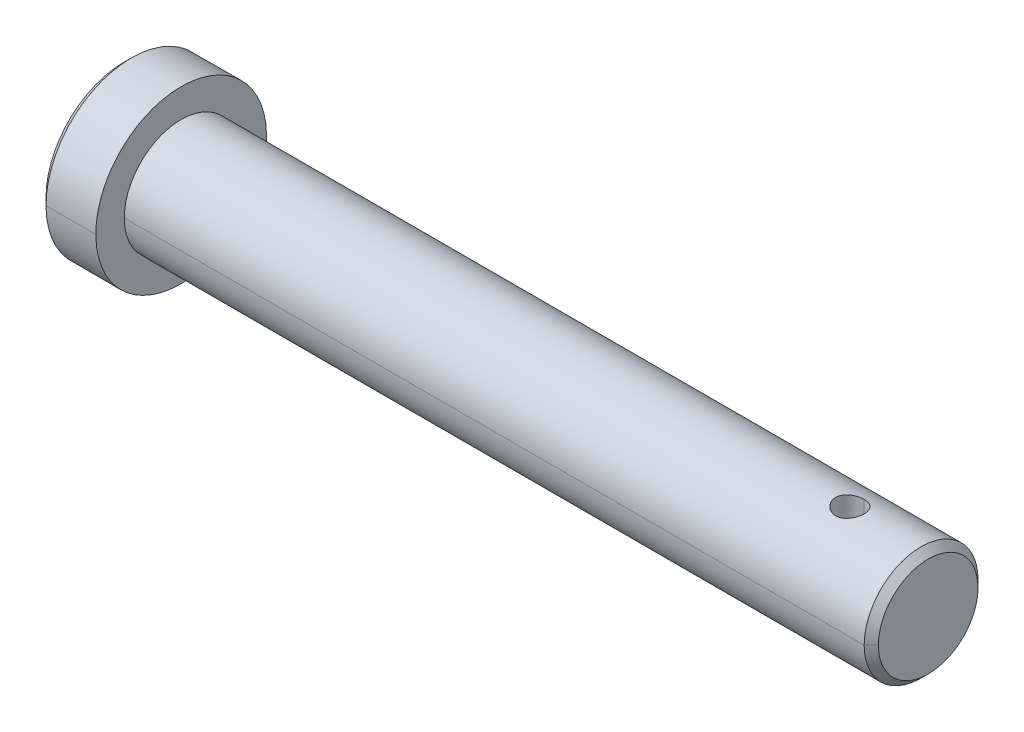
ISO-10303-21;
HEADER;
FILE_DESCRIPTION(('STEP AP214'),'2;1');
FILE_NAME('part.step','',(''),(''),'','','');
FILE_SCHEMA(('AUTOMOTIVE_DESIGN { 1 0 10303 214 1 1 1 1 }'));
ENDSEC;
DATA;
#1=APPLICATION_CONTEXT('core data for automotive mechanical design processes');
#2=APPLICATION_PROTOCOL_DEFINITION('international standard','automotive_design',2000,#1);
#3=PRODUCT_CONTEXT('',#1,'mechanical');
#4=PRODUCT('Part','Part','',(#3));
#5=PRODUCT_RELATED_PRODUCT_CATEGORY('part','',(#4));
#6=PRODUCT_DEFINITION_FORMATION('','',#4);
#7=PRODUCT_DEFINITION_CONTEXT('part definition',#1,'design');
#8=PRODUCT_DEFINITION('design','',#6,#7);
#9=PRODUCT_DEFINITION_SHAPE('','',#8);
#10=(LENGTH_UNIT() NAMED_UNIT(*) SI_UNIT(.MILLI.,.METRE.));
#11=(NAMED_UNIT(*) PLANE_ANGLE_UNIT() SI_UNIT($,.RADIAN.));
#12=(NAMED_UNIT(*) SI_UNIT($,.STERADIAN.) SOLID_ANGLE_UNIT());
#13=UNCERTAINTY_MEASURE_WITH_UNIT(LENGTH_MEASURE(1.E-05),#10,'distance_accuracy_value','');
#14=(GEOMETRIC_REPRESENTATION_CONTEXT(3) GLOBAL_UNCERTAINTY_ASSIGNED_CONTEXT((#13)) GLOBAL_UNIT_ASSIGNED_CONTEXT((#10,
#11,#12)) REPRESENTATION_CONTEXT('',''));
#15=CARTESIAN_POINT('',(0.,0.,0.));
#16=DIRECTION('',(0.,0.,1.));
#17=DIRECTION('',(1.,0.,0.));
#18=AXIS2_PLACEMENT_3D('',#15,#16,#17);
#19=CARTESIAN_POINT('',(29.9221543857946,-1.83255883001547E-08,-1.54758532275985E-07));
#20=DIRECTION('',(-1.,0.,0.));
#21=DIRECTION('',(0.,1.,0.));
#22=AXIS2_PLACEMENT_3D('',#19,#20,#21);
#23=CYLINDRICAL_SURFACE('',#22,6.);
#24=CARTESIAN_POINT('',(29.9221543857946,-1.83255797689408E-08,5.99999984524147));
#25=CARTESIAN_POINT('',(29.9221543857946,-1.09299904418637,5.99955577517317));
#26=CARTESIAN_POINT('',(29.9221543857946,-2.16363584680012,5.70220149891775));
#27=CARTESIAN_POINT('',(29.9221543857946,-4.00537227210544,4.59070899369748));
#28=CARTESIAN_POINT('',(29.9221543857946,-4.75100918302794,3.81381022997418));
#29=CARTESIAN_POINT('',(29.9221543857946,-5.9543945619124,1.62173642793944));
#30=CARTESIAN_POINT('',(29.9221543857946,-6.16936715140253,0.148484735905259));
#31=CARTESIAN_POINT('',(29.9221543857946,-5.67356891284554,-2.15615614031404));
#32=CARTESIAN_POINT('',(29.9221543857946,-5.27945008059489,-2.99374934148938));
#33=CARTESIAN_POINT('',(29.9221543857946,-3.77053044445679,-4.90959764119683));
#34=CARTESIAN_POINT('',(29.9221543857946,-2.40783798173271,-5.70334203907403));
#35=CARTESIAN_POINT('',(29.9221543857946,-0.60224902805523,-5.97718803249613));
#36=CARTESIAN_POINT('',(29.9221543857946,-0.301334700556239,-5.99987772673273));
#37=CARTESIAN_POINT('',(29.9221543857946,-1.83255797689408E-08,-6.00000015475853));
#38=B_SPLINE_CURVE_WITH_KNOTS('',3,(#24,#25,#26,#27,#28,#29,#30,#31,#32,#33,#34,#35,#36,#37),
.UNSPECIFIED.,.F.,.F.,(4,2,2,2,2,2,4),(0.,0.172601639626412,0.339653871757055,0.567466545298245,
0.711758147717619,0.952421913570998,1.),.UNSPECIFIED.);
#39=CARTESIAN_POINT('',(29.9221543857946,-1.83255876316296E-08,5.99999984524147));
#40=VERTEX_POINT('',#39);
#41=CARTESIAN_POINT('',(29.9221543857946,-1.83255875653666E-08,-6.00000015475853));
#42=VERTEX_POINT('',#41);
#43=EDGE_CURVE('E11',#40,#42,#38,.T.);
#44=ORIENTED_EDGE('',*,*,#43,.F.);
#45=CARTESIAN_POINT('',(29.9221543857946,-1.83255884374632E-08,5.99999984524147));
#46=DIRECTION('',(-1.,0.,0.));
#47=VECTOR('',#46,1.);
#48=LINE('',#45,#47);
#49=CARTESIAN_POINT('',(26.4221543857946,-1.83255890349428E-08,5.99999984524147));
#50=VERTEX_POINT('',#49);
#51=EDGE_CURVE('E25',#40,#50,#48,.T.);
#52=ORIENTED_EDGE('',*,*,#51,.T.);
#53=CARTESIAN_POINT('',(26.4221543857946,-1.83255883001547E-08,-1.54758532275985E-07));
#54=DIRECTION('',(1.,0.,0.));
#55=DIRECTION('',(0.,0.,1.));
#56=AXIS2_PLACEMENT_3D('',#53,#54,#55);
#57=CIRCLE('',#56,6.);
#58=CARTESIAN_POINT('',(26.4221543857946,-1.83255886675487E-08,-6.00000015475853));
#59=VERTEX_POINT('',#58);
#60=EDGE_CURVE('E108',#50,#59,#57,.T.);
#61=ORIENTED_EDGE('',*,*,#60,.T.);
#62=CARTESIAN_POINT('',(26.4221543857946,-1.83256088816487E-08,-6.00000015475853));
#63=DIRECTION('',(1.,0.,0.));
#64=VECTOR('',#63,1.);
#65=LINE('',#62,#64);
#66=EDGE_CURVE('E240',#59,#42,#65,.T.);
#67=ORIENTED_EDGE('',*,*,#66,.T.);
#68=EDGE_LOOP('',(#44,#52,#61,#67));
#69=FACE_BOUND('',#68,.T.);
#70=ADVANCED_FACE('F16',(#69),#23,.T.);
#71=CARTESIAN_POINT('',(29.9221543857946,-1.83255883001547E-08,-1.54758532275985E-07));
#72=DIRECTION('',(-1.,0.,0.));
#73=DIRECTION('',(0.,-1.,0.));
#74=AXIS2_PLACEMENT_3D('',#71,#72,#73);
#75=CYLINDRICAL_SURFACE('',#74,6.);
#76=CARTESIAN_POINT('',(26.4221543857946,-1.83255883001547E-08,-1.54758532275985E-07));
#77=DIRECTION('',(1.,0.,0.));
#78=DIRECTION('',(0.,0.,-1.));
#79=AXIS2_PLACEMENT_3D('',#76,#77,#78);
#80=CIRCLE('',#79,6.);
#81=EDGE_CURVE('E236',#59,#50,#80,.T.);
#82=ORIENTED_EDGE('',*,*,#81,.T.);
#83=ORIENTED_EDGE('',*,*,#51,.F.);
#84=CARTESIAN_POINT('',(29.9221543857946,-1.83255797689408E-08,-6.00000015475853));
#85=CARTESIAN_POINT('',(29.9221543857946,1.0929990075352,-5.99955608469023));
#86=CARTESIAN_POINT('',(29.9221543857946,2.16363581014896,-5.70220180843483));
#87=CARTESIAN_POINT('',(29.9221543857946,4.00537223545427,-4.59070930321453));
#88=CARTESIAN_POINT('',(29.9221543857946,4.75100914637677,-3.81381053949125));
#89=CARTESIAN_POINT('',(29.9221543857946,5.95439452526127,-1.6217367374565));
#90=CARTESIAN_POINT('',(29.9221543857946,6.16936711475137,-0.14848504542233));
#91=CARTESIAN_POINT('',(29.9221543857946,5.67356887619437,2.15615583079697));
#92=CARTESIAN_POINT('',(29.9221543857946,5.27945004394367,2.99374903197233));
#93=CARTESIAN_POINT('',(29.9221543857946,3.77053040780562,4.90959733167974));
#94=CARTESIAN_POINT('',(29.9221543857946,2.40783794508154,5.70334172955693));
#95=CARTESIAN_POINT('',(29.9221543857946,0.60224899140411,5.97718772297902));
#96=CARTESIAN_POINT('',(29.9221543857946,0.301334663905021,5.99987741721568));
#97=CARTESIAN_POINT('',(29.9221543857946,-1.83255797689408E-08,5.99999984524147));
#98=B_SPLINE_CURVE_WITH_KNOTS('',3,(#84,#85,#86,#87,#88,#89,#90,#91,#92,#93,#94,#95,#96,#97),
.UNSPECIFIED.,.F.,.F.,(4,2,2,2,2,2,4),(0.,0.17260163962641,0.339653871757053,0.567466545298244,
0.711758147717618,0.952421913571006,1.),.UNSPECIFIED.);
#99=EDGE_CURVE('E233',#42,#40,#98,.T.);
#100=ORIENTED_EDGE('',*,*,#99,.F.);
#101=ORIENTED_EDGE('',*,*,#66,.F.);
#102=EDGE_LOOP('',(#82,#83,#100,#101));
#103=FACE_BOUND('',#102,.T.);
#104=ADVANCED_FACE('F249',(#103),#75,.T.);
#105=CARTESIAN_POINT('',(29.9221543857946,-6.16936715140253,5.99999984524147));
#106=DIRECTION('',(1.,0.,0.));
#107=DIRECTION('',(0.,0.,-1.));
#108=AXIS2_PLACEMENT_3D('',#105,#106,#107);
#109=PLANE('',#108);
#110=ORIENTED_EDGE('',*,*,#99,.T.);
#111=ORIENTED_EDGE('',*,*,#43,.T.);
#112=EDGE_LOOP('',(#110,#111));
#113=FACE_BOUND('',#112,.T.);
#114=CARTESIAN_POINT('',(29.9221543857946,-1.83255883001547E-08,-1.54758532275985E-07));
#115=DIRECTION('',(1.,0.,0.));
#116=DIRECTION('',(0.,-0.789846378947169,0.613304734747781));
#117=AXIS2_PLACEMENT_3D('',#114,#115,#116);
#118=CIRCLE('',#117,4.);
#119=CARTESIAN_POINT('',(29.9221543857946,-3.15936905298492,2.45320598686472));
#120=VERTEX_POINT('',#119);
#121=CARTESIAN_POINT('',(29.9221543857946,1.75885421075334,-3.5925568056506));
#122=VERTEX_POINT('',#121);
#123=EDGE_CURVE('E231',#120,#122,#118,.T.);
#124=ORIENTED_EDGE('',*,*,#123,.F.);
#125=CARTESIAN_POINT('',(29.9221543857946,-1.83255883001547E-08,-1.54758532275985E-07));
#126=DIRECTION('',(1.,0.,0.));
#127=DIRECTION('',(0.,0.,1.));
#128=AXIS2_PLACEMENT_3D('',#125,#126,#127);
#129=CIRCLE('',#128,4.);
#130=CARTESIAN_POINT('',(29.9221543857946,-1.83255871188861E-08,3.99999984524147));
#131=VERTEX_POINT('',#130);
#132=EDGE_CURVE('E229',#131,#120,#129,.T.);
#133=ORIENTED_EDGE('',*,*,#132,.F.);
#134=CARTESIAN_POINT('',(29.9221543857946,-1.83255883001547E-08,-1.54758532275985E-07));
#135=DIRECTION('',(1.,0.,0.));
#136=DIRECTION('',(0.,0.439713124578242,-0.898138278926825));
#137=AXIS2_PLACEMENT_3D('',#134,#135,#136);
#138=CIRCLE('',#137,4.);
#139=EDGE_CURVE('E226',#122,#131,#138,.T.);
#140=ORIENTED_EDGE('',*,*,#139,.F.);
#141=EDGE_LOOP('',(#124,#133,#140));
#142=FACE_BOUND('',#141,.T.);
#143=ADVANCED_FACE('F604',(#113,#142),#109,.T.);
#144=CARTESIAN_POINT('',(81.9221543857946,-1.83255883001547E-08,-1.54758532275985E-07));
#145=DIRECTION('',(-1.,0.,0.));
#146=DIRECTION('',(0.,-0.974201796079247,-0.225678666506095));
#147=AXIS2_PLACEMENT_3D('',#144,#145,#146);
#148=CYLINDRICAL_SURFACE('',#147,4.);
#149=ORIENTED_EDGE('',*,*,#139,.T.);
#150=CARTESIAN_POINT('',(81.9221543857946,-1.83256067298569E-08,3.99999984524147));
#151=DIRECTION('',(-1.,0.,0.));
#152=VECTOR('',#151,1.);
#153=LINE('',#150,#152);
#154=CARTESIAN_POINT('',(81.9221543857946,-1.8325588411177E-08,3.99999984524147));
#155=VERTEX_POINT('',#154);
#156=EDGE_CURVE('E223',#155,#131,#153,.T.);
#157=ORIENTED_EDGE('',*,*,#156,.F.);
#158=CARTESIAN_POINT('',(81.9221543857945,-1.83255883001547E-08,-1.54758532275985E-07));
#159=DIRECTION('',(-1.,0.,0.));
#160=DIRECTION('',(0.,0.,1.));
#161=AXIS2_PLACEMENT_3D('',#158,#159,#160);
#162=CIRCLE('',#161,4.);
#163=CARTESIAN_POINT('',(81.9221543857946,1.75885247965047,-3.59255327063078));
#164=VERTEX_POINT('',#163);
#165=EDGE_CURVE('E219',#155,#164,#162,.T.);
#166=ORIENTED_EDGE('',*,*,#165,.T.);
#167=CARTESIAN_POINT('',(29.9221543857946,1.75885247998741,-3.59255327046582));
#168=CARTESIAN_POINT('',(32.0888210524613,1.75885247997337,-3.59255327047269));
#169=CARTESIAN_POINT('',(34.2554877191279,1.75885247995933,-3.59255327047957));
#170=CARTESIAN_POINT('',(38.5888210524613,1.75885247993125,-3.59255327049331));
#171=CARTESIAN_POINT('',(40.7554877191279,1.75885247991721,-3.59255327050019));
#172=CARTESIAN_POINT('',(45.0888210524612,1.75885247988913,-3.59255327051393));
#173=CARTESIAN_POINT('',(47.2554877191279,1.75885247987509,-3.59255327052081));
#174=CARTESIAN_POINT('',(51.5888210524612,1.75885247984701,-3.59255327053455));
#175=CARTESIAN_POINT('',(53.7554877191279,1.75885247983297,-3.59255327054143));
#176=CARTESIAN_POINT('',(58.0888210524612,1.75885247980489,-3.59255327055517));
#177=CARTESIAN_POINT('',(60.2554877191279,1.75885247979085,-3.59255327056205));
#178=CARTESIAN_POINT('',(64.5888210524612,1.75885247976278,-3.59255327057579));
#179=CARTESIAN_POINT('',(66.7554877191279,1.75885247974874,-3.59255327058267));
#180=CARTESIAN_POINT('',(71.0888210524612,1.75885247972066,-3.59255327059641));
#181=CARTESIAN_POINT('',(73.2554877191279,1.75885247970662,-3.59255327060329));
#182=CARTESIAN_POINT('',(77.5888210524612,1.75885247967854,-3.59255327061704));
#183=CARTESIAN_POINT('',(79.7554877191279,1.7588524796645,-3.59255327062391));
#184=CARTESIAN_POINT('',(81.9221543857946,1.75885247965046,-3.59255327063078));
#185=B_SPLINE_CURVE_WITH_KNOTS('',3,(#167,#168,#169,#170,#171,#172,#173,#174,#175,#176,#177,
#178,#179,#180,#181,#182,#183,#184),.UNSPECIFIED.,.F.,.F.,(4,2,2,2,2,2,2,2,4),(0.,6.5,13.,19.5,
26.,32.5,39.,45.5,52.),.UNSPECIFIED.);
#186=EDGE_CURVE('E217',#122,#164,#185,.T.);
#187=ORIENTED_EDGE('',*,*,#186,.F.);
#188=EDGE_LOOP('',(#149,#157,#166,#187));
#189=FACE_BOUND('',#188,.T.);
#190=CARTESIAN_POINT('',(76.9221543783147,3.87298755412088,-0.999983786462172));
#191=CARTESIAN_POINT('',(76.9339354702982,3.87298798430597,-0.999981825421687));
#192=CARTESIAN_POINT('',(76.9457165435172,3.87304199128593,-0.999772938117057));
#193=CARTESIAN_POINT('',(76.9692445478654,3.87325645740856,-0.998941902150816));
#194=CARTESIAN_POINT('',(76.9809915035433,3.8734167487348,-0.998320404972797));
#195=CARTESIAN_POINT('',(77.0044413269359,3.87384284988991,-0.996665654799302));
#196=CARTESIAN_POINT('',(77.0161442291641,3.87410854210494,-0.995632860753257));
#197=CARTESIAN_POINT('',(77.0394960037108,3.87474396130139,-0.993157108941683));
#198=CARTESIAN_POINT('',(77.0511449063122,3.87511362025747,-0.991714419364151));
#199=CARTESIAN_POINT('',(77.0743787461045,3.87595515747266,-0.988420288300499));
#200=CARTESIAN_POINT('',(77.0859636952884,3.87642701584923,-0.98656892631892));
#201=CARTESIAN_POINT('',(77.1090597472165,3.87747071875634,-0.982458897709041));
#202=CARTESIAN_POINT('',(77.1205708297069,3.87804258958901,-0.980200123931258));
#203=CARTESIAN_POINT('',(77.1435091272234,3.87928381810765,-0.975276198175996));
#204=CARTESIAN_POINT('',(77.1549362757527,3.87995324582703,-0.972610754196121));
#205=CARTESIAN_POINT('',(77.1776972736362,3.88138633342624,-0.966875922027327));
#206=CARTESIAN_POINT('',(77.1890309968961,3.88215010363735,-0.963806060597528));
#207=CARTESIAN_POINT('',(77.2115875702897,3.88376927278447,-0.957260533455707));
#208=CARTESIAN_POINT('',(77.2228102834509,3.88462477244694,-0.95378442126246));
#209=CARTESIAN_POINT('',(77.2450395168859,3.88640970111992,-0.946484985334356));
#210=CARTESIAN_POINT('',(77.2560470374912,3.8873385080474,-0.942664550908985));
#211=CARTESIAN_POINT('',(77.2778074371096,3.88926217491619,-0.934695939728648));
#212=CARTESIAN_POINT('',(77.2885617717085,3.89025625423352,-0.93055155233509));
#213=CARTESIAN_POINT('',(77.3098163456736,3.8923056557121,-0.921941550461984));
#214=CARTESIAN_POINT('',(77.3203180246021,3.89336031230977,-0.917479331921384));
#215=CARTESIAN_POINT('',(77.3410682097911,3.89552576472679,-0.908240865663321));
#216=CARTESIAN_POINT('',(77.3513181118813,3.89663600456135,-0.903467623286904));
#217=CARTESIAN_POINT('',(77.3715655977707,3.89890745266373,-0.893614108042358));
#218=CARTESIAN_POINT('',(77.3815645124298,3.90006820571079,-0.888536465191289));
#219=CARTESIAN_POINT('',(77.4013109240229,3.90243540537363,-0.878081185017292));
#220=CARTESIAN_POINT('',(77.4110596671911,3.90364148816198,-0.872705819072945));
#221=CARTESIAN_POINT('',(77.4303066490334,3.90609400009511,-0.861662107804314));
#222=CARTESIAN_POINT('',(77.4398060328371,3.9073401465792,-0.85599569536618));
#223=CARTESIAN_POINT('',(77.4585552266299,3.90986737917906,-0.844376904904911));
#224=CARTESIAN_POINT('',(77.4678060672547,3.91114825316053,-0.838426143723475));
#225=CARTESIAN_POINT('',(77.4860591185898,3.91373949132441,-0.826245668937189));
#226=CARTESIAN_POINT('',(77.4950622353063,3.91504970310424,-0.820017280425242));
#227=CARTESIAN_POINT('',(77.5128207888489,3.91769414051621,-0.807288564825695));
#228=CARTESIAN_POINT('',(77.5215770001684,3.91902826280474,-0.800789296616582));
#229=CARTESIAN_POINT('',(77.5388427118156,3.92171503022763,-0.787525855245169));
#230=CARTESIAN_POINT('',(77.5473528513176,3.9230676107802,-0.780762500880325));
#231=CARTESIAN_POINT('',(77.5641273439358,3.92578581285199,-0.766977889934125));
#232=CARTESIAN_POINT('',(77.5723922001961,3.92715139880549,-0.759957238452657));
#233=CARTESIAN_POINT('',(77.5886772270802,3.92989011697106,-0.745665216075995));
#234=CARTESIAN_POINT('',(77.596697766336,3.93126323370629,-0.738394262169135));
#235=CARTESIAN_POINT('',(77.6124946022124,3.93401165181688,-0.723608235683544));
#236=CARTESIAN_POINT('',(77.6202711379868,3.93538694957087,-0.716093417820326));
#237=CARTESIAN_POINT('',(77.6355819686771,3.93813386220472,-0.700829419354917));
#238=CARTESIAN_POINT('',(77.6431164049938,3.9395054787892,-0.693080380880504));
#239=CARTESIAN_POINT('',(77.6579043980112,3.94223510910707,-0.677381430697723));
#240=CARTESIAN_POINT('',(77.6651590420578,3.94359315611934,-0.669432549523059));
#241=CARTESIAN_POINT('',(77.6793673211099,3.94628860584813,-0.653354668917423));
#242=CARTESIAN_POINT('',(77.6863225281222,3.94762608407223,-0.645227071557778));
#243=CARTESIAN_POINT('',(77.699932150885,3.9502759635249,-0.628799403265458));
#244=CARTESIAN_POINT('',(77.7065880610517,3.95158846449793,-0.620500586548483));
#245=CARTESIAN_POINT('',(77.719598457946,3.95418420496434,-0.60373741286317));
#246=CARTESIAN_POINT('',(77.7259543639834,3.95546756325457,-0.595274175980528));
#247=CARTESIAN_POINT('',(77.7383643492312,3.95800092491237,-0.578189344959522));
#248=CARTESIAN_POINT('',(77.7444197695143,3.95925106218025,-0.56956874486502));
#249=CARTESIAN_POINT('',(77.7562283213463,3.96171403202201,-0.552176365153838));
#250=CARTESIAN_POINT('',(77.7619827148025,3.96292700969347,-0.543405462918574));
#251=CARTESIAN_POINT('',(77.7731887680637,3.9653118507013,-0.525719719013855));
#252=CARTESIAN_POINT('',(77.7786416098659,3.96648386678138,-0.516805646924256));
#253=CARTESIAN_POINT('',(77.7892441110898,3.96878312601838,-0.498840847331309));
#254=CARTESIAN_POINT('',(77.7943948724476,3.96991052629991,-0.489790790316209));
#255=CARTESIAN_POINT('',(77.8043927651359,3.97211705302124,-0.471561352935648));
#256=CARTESIAN_POINT('',(77.8092409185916,3.97319633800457,-0.462382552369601));
#257=CARTESIAN_POINT('',(77.8186331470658,3.97530329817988,-0.443903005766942));
#258=CARTESIAN_POINT('',(77.8231781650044,3.97633113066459,-0.434602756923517));
#259=CARTESIAN_POINT('',(77.8319636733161,3.97833202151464,-0.415887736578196));
#260=CARTESIAN_POINT('',(77.8362050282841,3.97930523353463,-0.406473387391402));
#261=CARTESIAN_POINT('',(77.8443827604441,3.98119389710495,-0.387537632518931));
#262=CARTESIAN_POINT('',(77.84831992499,3.98210949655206,-0.378016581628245));
#263=CARTESIAN_POINT('',(77.8558888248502,3.98388013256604,-0.358874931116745));
#264=CARTESIAN_POINT('',(77.8595212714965,3.98473530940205,-0.349254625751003));
#265=CARTESIAN_POINT('',(77.8664802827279,3.98638248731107,-0.329922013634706));
#266=CARTESIAN_POINT('',(77.8698074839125,3.98717461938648,-0.320209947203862));
#267=CARTESIAN_POINT('',(77.8761555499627,3.98869328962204,-0.300701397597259));
#268=CARTESIAN_POINT('',(77.8791769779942,3.98941994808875,-0.290905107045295));
#269=CARTESIAN_POINT('',(77.8849130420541,3.99080545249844,-0.27123572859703));
#270=CARTESIAN_POINT('',(77.8876281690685,3.99146440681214,-0.261362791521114));
#271=CARTESIAN_POINT('',(77.892751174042,3.99271248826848,-0.241547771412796));
#272=CARTESIAN_POINT('',(77.8951594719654,3.99330171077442,-0.231605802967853));
#273=CARTESIAN_POINT('',(77.899668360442,3.99440852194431,-0.211660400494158));
#274=CARTESIAN_POINT('',(77.9017693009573,3.99492619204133,-0.201657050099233));
#275=CARTESIAN_POINT('',(77.9056630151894,3.99588830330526,-0.18159658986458));
#276=CARTESIAN_POINT('',(77.9074560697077,3.99633281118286,-0.171539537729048));
#277=CARTESIAN_POINT('',(77.9107335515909,3.99714721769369,-0.151379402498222));
#278=CARTESIAN_POINT('',(77.9122181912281,3.99751716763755,-0.141276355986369));
#279=CARTESIAN_POINT('',(77.914878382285,3.99818129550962,-0.121031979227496));
#280=CARTESIAN_POINT('',(77.9160540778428,3.99847550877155,-0.110890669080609));
#281=CARTESIAN_POINT('',(77.9180959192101,3.99898722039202,-0.0905775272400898));
#282=CARTESIAN_POINT('',(77.9189621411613,3.9992047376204,-0.0804057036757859));
#283=CARTESIAN_POINT('',(77.9203845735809,3.99956233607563,-0.0600393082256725));
#284=CARTESIAN_POINT('',(77.9209407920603,3.9997024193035,-0.0498447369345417));
#285=CARTESIAN_POINT('',(77.9217427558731,3.99990465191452,-0.0294406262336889));
#286=CARTESIAN_POINT('',(77.9219884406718,3.99996678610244,-0.0192310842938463));
#287=CARTESIAN_POINT('',(77.9221688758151,4.00001284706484,0.00119518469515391));
#288=CARTESIAN_POINT('',(77.9221034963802,3.99999674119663,0.011411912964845));
#289=CARTESIAN_POINT('',(77.9216613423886,3.99988627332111,0.0318447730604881));
#290=CARTESIAN_POINT('',(77.9212843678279,3.99979186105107,0.0420609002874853));
#291=CARTESIAN_POINT('',(77.9202185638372,3.99952495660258,0.0624847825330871));
#292=CARTESIAN_POINT('',(77.9195294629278,3.99935239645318,0.0726925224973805));
#293=CARTESIAN_POINT('',(77.9178389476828,3.99892959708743,0.093091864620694));
#294=CARTESIAN_POINT('',(77.9168371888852,3.99867927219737,0.103283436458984));
#295=CARTESIAN_POINT('',(77.9145209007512,3.99810156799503,0.123642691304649));
#296=CARTESIAN_POINT('',(77.913205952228,3.99777408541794,0.133810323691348));
#297=CARTESIAN_POINT('',(77.9102628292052,3.99704291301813,0.154113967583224));
#298=CARTESIAN_POINT('',(77.9086341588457,3.99663910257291,0.16424990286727));
#299=CARTESIAN_POINT('',(77.9050631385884,3.99575634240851,0.184482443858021));
#300=CARTESIAN_POINT('',(77.9031202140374,3.99527725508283,0.194578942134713));
#301=CARTESIAN_POINT('',(77.8989202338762,3.99424522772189,0.214724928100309));
#302=CARTESIAN_POINT('',(77.8966625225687,3.9936921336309,0.224774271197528));
#303=CARTESIAN_POINT('',(77.8918325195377,3.99251359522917,0.244818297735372));
#304=CARTESIAN_POINT('',(77.8892594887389,3.99188798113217,0.254812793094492));
#305=CARTESIAN_POINT('',(77.8837983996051,3.99056611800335,0.274739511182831));
#306=CARTESIAN_POINT('',(77.8809095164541,3.9898696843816,0.284671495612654));
#307=CARTESIAN_POINT('',(77.8748162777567,3.98840810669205,0.304465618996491));
#308=CARTESIAN_POINT('',(77.8716110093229,3.98764276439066,0.314327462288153));
#309=CARTESIAN_POINT('',(77.8648845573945,3.98604549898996,0.333973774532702));
#310=CARTESIAN_POINT('',(77.8613623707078,3.98521336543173,0.343757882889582));
#311=CARTESIAN_POINT('',(77.8540016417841,3.98348484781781,0.363241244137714));
#312=CARTESIAN_POINT('',(77.8501620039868,3.98258824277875,0.372940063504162));
#313=CARTESIAN_POINT('',(77.8421659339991,3.98073330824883,0.392245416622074));
#314=CARTESIAN_POINT('',(77.8380083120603,3.97977474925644,0.401851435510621));
#315=CARTESIAN_POINT('',(77.829375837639,3.97779862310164,0.420963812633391));
#316=CARTESIAN_POINT('',(77.8248996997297,3.97678082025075,0.430469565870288));
#317=CARTESIAN_POINT('',(77.8156297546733,3.97468910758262,0.449374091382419));
#318=CARTESIAN_POINT('',(77.8108345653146,3.97361495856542,0.458772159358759));
#319=CARTESIAN_POINT('',(77.8009260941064,3.97141363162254,0.477454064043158));
#320=CARTESIAN_POINT('',(77.79581133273,3.97028621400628,0.486737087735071));
#321=CARTESIAN_POINT('',(77.7852632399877,3.9679816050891,0.505181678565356));
#322=CARTESIAN_POINT('',(77.7798283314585,3.9668041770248,0.514342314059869));
#323=CARTESIAN_POINT('',(77.7686396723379,3.964402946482,0.532535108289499));
#324=CARTESIAN_POINT('',(77.7628842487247,3.96317891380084,0.54156620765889));
#325=CARTESIAN_POINT('',(77.7510535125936,3.96068810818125,0.55949244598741));
#326=CARTESIAN_POINT('',(77.7449764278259,3.95942111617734,0.568386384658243));
#327=CARTESIAN_POINT('',(77.7325186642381,3.95685086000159,0.586012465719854));
#328=CARTESIAN_POINT('',(77.7261367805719,3.95554746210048,0.594743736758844));
#329=CARTESIAN_POINT('',(77.7130939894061,3.95291307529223,0.612008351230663));
#330=CARTESIAN_POINT('',(77.7064327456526,3.95158205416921,0.620541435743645));
#331=CARTESIAN_POINT('',(77.6928309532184,3.94889767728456,0.637400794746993));
#332=CARTESIAN_POINT('',(77.6858899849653,3.94754428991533,0.645726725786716));
#333=CARTESIAN_POINT('',(77.6717297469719,3.94482034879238,0.662164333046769));
#334=CARTESIAN_POINT('',(77.6645099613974,3.94344976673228,0.670275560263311));
#335=CARTESIAN_POINT('',(77.649792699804,3.9406967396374,0.686276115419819));
#336=CARTESIAN_POINT('',(77.6422946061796,3.93931427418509,0.694164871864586));
#337=CARTESIAN_POINT('',(77.6270214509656,3.93654285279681,0.709712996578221));
#338=CARTESIAN_POINT('',(77.6192456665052,3.93515388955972,0.717371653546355));
#339=CARTESIAN_POINT('',(77.6034178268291,3.93237491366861,0.732452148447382));
#340=CARTESIAN_POINT('',(77.5953649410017,3.93098491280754,0.73987311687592));
#341=CARTESIAN_POINT('',(77.5789836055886,3.92820935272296,0.754470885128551));
#342=CARTESIAN_POINT('',(77.5706542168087,3.92682383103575,0.761646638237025));
#343=CARTESIAN_POINT('',(77.5537205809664,3.9240627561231,0.775746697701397));
#344=CARTESIAN_POINT('',(77.5451152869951,3.92268727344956,0.782669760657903));
#345=CARTESIAN_POINT('',(77.527630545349,3.91995182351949,0.796257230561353));
#346=CARTESIAN_POINT('',(77.5187499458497,3.9185919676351,0.802920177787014));
#347=CARTESIAN_POINT('',(77.5007152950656,3.91589332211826,0.815980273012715));
#348=CARTESIAN_POINT('',(77.4915599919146,3.91455469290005,0.822375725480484));
#349=CARTESIAN_POINT('',(77.4729766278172,3.91190404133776,0.834893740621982));
#350=CARTESIAN_POINT('',(77.4635472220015,3.910592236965,0.841014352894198));
#351=CARTESIAN_POINT('',(77.4444163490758,3.90800074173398,0.852975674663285));
#352=CARTESIAN_POINT('',(77.4347134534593,3.90672133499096,0.85881416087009));
#353=CARTESIAN_POINT('',(77.4150362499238,3.90420011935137,0.870204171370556));
#354=CARTESIAN_POINT('',(77.4050604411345,3.90295866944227,0.875753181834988));
#355=CARTESIAN_POINT('',(77.3848381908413,3.90051870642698,0.88655756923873));
#356=CARTESIAN_POINT('',(77.3745901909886,3.89932063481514,0.891810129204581));
#357=CARTESIAN_POINT('',(77.3538237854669,3.89697300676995,0.902013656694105));
#358=CARTESIAN_POINT('',(77.3433037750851,3.89582398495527,0.906961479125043));
#359=CARTESIAN_POINT('',(77.3220057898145,3.89357981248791,0.916547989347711));
#360=CARTESIAN_POINT('',(77.3112263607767,3.89248522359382,0.921183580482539));
#361=CARTESIAN_POINT('',(77.289497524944,3.89037019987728,0.930075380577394));
#362=CARTESIAN_POINT('',(77.2785480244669,3.8893498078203,0.934331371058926));
#363=CARTESIAN_POINT('',(77.2565125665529,3.88739039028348,0.94245049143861));
#364=CARTESIAN_POINT('',(77.2454267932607,3.88645126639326,0.946314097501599));
#365=CARTESIAN_POINT('',(77.2231299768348,3.88465866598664,0.953646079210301));
#366=CARTESIAN_POINT('',(77.2119190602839,3.88380511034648,0.957114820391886));
#367=CARTESIAN_POINT('',(77.1893831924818,3.88218762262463,0.963654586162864));
#368=CARTESIAN_POINT('',(77.1780583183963,3.88142363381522,0.966725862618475));
#369=CARTESIAN_POINT('',(77.1553057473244,3.87998891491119,0.972468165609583));
#370=CARTESIAN_POINT('',(77.1438780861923,3.87931815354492,0.975139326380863));
#371=CARTESIAN_POINT('',(77.1209311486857,3.87807318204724,0.980078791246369));
#372=CARTESIAN_POINT('',(77.1094118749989,3.8774989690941,0.982347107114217));
#373=CARTESIAN_POINT('',(77.086292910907,3.87645003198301,0.986478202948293));
#374=CARTESIAN_POINT('',(77.0746931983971,3.87597533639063,0.988340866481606));
#375=CARTESIAN_POINT('',(77.0514245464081,3.87512801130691,0.991657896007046));
#376=CARTESIAN_POINT('',(77.03975556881,3.87475544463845,0.993112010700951));
#377=CARTESIAN_POINT('',(77.0163595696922,3.87411457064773,0.995609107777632));
#378=CARTESIAN_POINT('',(77.0046325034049,3.87384636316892,0.996651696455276));
#379=CARTESIAN_POINT('',(76.9811314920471,3.87341605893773,0.998322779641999));
#380=CARTESIAN_POINT('',(76.9693575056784,3.87325410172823,0.998950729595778));
#381=CARTESIAN_POINT('',(76.9457738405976,3.87303760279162,0.999789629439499));
#382=CARTESIAN_POINT('',(76.9339641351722,3.8729832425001,0.999999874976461));
#383=CARTESIAN_POINT('',(76.9221543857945,3.87298332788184,0.999999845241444));
#384=B_SPLINE_CURVE_WITH_KNOTS('',3,(#190,#191,#192,#193,#194,#195,#196,#197,#198,#199,#200,
#201,#202,#203,#204,#205,#206,#207,#208,#209,#210,#211,#212,#213,#214,#215,#216,#217,#218,#219,
#220,#221,#222,#223,#224,#225,#226,#227,#228,#229,#230,#231,#232,#233,#234,#235,#236,#237,#238,
#239,#240,#241,#242,#243,#244,#245,#246,#247,#248,#249,#250,#251,#252,#253,#254,#255,#256,#257,
#258,#259,#260,#261,#262,#263,#264,#265,#266,#267,#268,#269,#270,#271,#272,#273,#274,#275,#276,
#277,#278,#279,#280,#281,#282,#283,#284,#285,#286,#287,#288,#289,#290,#291,#292,#293,#294,#295,
#296,#297,#298,#299,#300,#301,#302,#303,#304,#305,#306,#307,#308,#309,#310,#311,#312,#313,#314,
#315,#316,#317,#318,#319,#320,#321,#322,#323,#324,#325,#326,#327,#328,#329,#330,#331,#332,#333,
#334,#335,#336,#337,#338,#339,#340,#341,#342,#343,#344,#345,#346,#347,#348,#349,#350,#351,#352,
#353,#354,#355,#356,#357,#358,#359,#360,#361,#362,#363,#364,#365,#366,#367,#368,#369,#370,#371,
#372,#373,#374,#375,#376,#377,#378,#379,#380,#381,#382,#383),.UNSPECIFIED.,.F.,.F.,(4,2,2,2,2,2,
2,2,2,2,2,2,2,2,2,2,2,2,2,2,2,2,2,2,2,2,2,2,2,2,2,2,2,2,2,2,2,2,2,2,2,2,2,2,2,2,2,2,2,2,2,2,2,2,
2,2,2,2,2,2,2,2,2,2,2,2,2,2,2,2,2,2,2,2,2,2,2,2,2,2,2,2,2,2,2,2,2,2,2,2,2,2,2,2,2,2,4),(0.,
0.0353413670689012,0.0706270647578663,0.105873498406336,0.141096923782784,0.176313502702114,
0.211539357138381,0.246790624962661,0.282083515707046,0.317415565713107,0.352474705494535,
0.387172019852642,0.421542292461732,0.455619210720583,0.489435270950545,0.523021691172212,
0.556408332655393,0.589623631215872,0.622694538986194,0.655646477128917,0.688503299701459,
0.721287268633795,0.754019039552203,0.786717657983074,0.819396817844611,0.851932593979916,
0.884269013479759,0.91642025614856,0.948399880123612,0.98022083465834,1.01189547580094,
1.04343558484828,1.0748523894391,1.10615658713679,1.1373583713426,1.16846745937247,
1.19949312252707,1.23044421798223,1.26132922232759,1.29215626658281,1.32293317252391,
1.35366749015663,1.3843665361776,1.41503743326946,1.44568715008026,1.47632254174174,
1.50695039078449,1.53757744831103,1.56821047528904,1.59885628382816,1.62952177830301,
1.66021399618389,1.69094014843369,1.72170765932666,1.75252420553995,1.78339775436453,
1.8143366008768,1.84534940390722,1.87644522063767,1.90763353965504,1.9389243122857,
1.97032798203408,2.00185551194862,2.0335184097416,2.06532875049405,2.0972991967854,
2.12944301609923,2.16177409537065,2.19430695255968,2.22698122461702,2.25969602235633,
2.29246186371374,2.32529153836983,2.35819902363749,2.39119951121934,2.42430942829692,
2.45754645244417,2.49092951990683,2.52447882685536,2.55821582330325,2.59216319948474,
2.6263448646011,2.6607859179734,2.69551261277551,2.73055231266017,2.76589975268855,
2.80126740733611,2.8365916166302,2.87188285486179,2.90715161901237,2.94240852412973,
2.97766439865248,3.01293037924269,3.04821800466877,3.08353930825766,3.11890690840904,
3.1543340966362),.UNSPECIFIED.);
#385=CARTESIAN_POINT('',(76.9221543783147,3.87298418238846,-0.999982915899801));
#386=VERTEX_POINT('',#385);
#387=CARTESIAN_POINT('',(76.9221543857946,3.87298332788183,0.999999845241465));
#388=VERTEX_POINT('',#387);
#389=EDGE_CURVE('E213',#386,#388,#384,.T.);
#390=ORIENTED_EDGE('',*,*,#389,.T.);
#391=CARTESIAN_POINT('',(76.9221543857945,3.87298332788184,0.999999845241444));
#392=CARTESIAN_POINT('',(76.9100425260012,3.87298330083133,0.999999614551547));
#393=CARTESIAN_POINT('',(76.8979309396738,3.87304176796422,0.999773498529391));
#394=CARTESIAN_POINT('',(76.8737055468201,3.87327354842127,0.998875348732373));
#395=CARTESIAN_POINT('',(76.8615917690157,3.87344704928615,0.998202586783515));
#396=CARTESIAN_POINT('',(76.837384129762,3.87390702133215,0.996415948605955));
#397=CARTESIAN_POINT('',(76.8252903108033,3.87419363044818,0.995301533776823));
#398=CARTESIAN_POINT('',(76.8011445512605,3.87487744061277,0.992636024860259));
#399=CARTESIAN_POINT('',(76.7890926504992,3.87527472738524,0.991084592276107));
#400=CARTESIAN_POINT('',(76.7650527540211,3.87617710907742,0.987549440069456));
#401=CARTESIAN_POINT('',(76.7530647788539,3.87668223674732,0.98556558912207));
#402=CARTESIAN_POINT('',(76.7291747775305,3.87779711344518,0.98116983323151));
#403=CARTESIAN_POINT('',(76.7172727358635,3.87840684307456,0.978758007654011));
#404=CARTESIAN_POINT('',(76.6935766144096,3.87972731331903,0.973510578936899));
#405=CARTESIAN_POINT('',(76.6817824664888,3.8804379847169,0.970675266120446));
#406=CARTESIAN_POINT('',(76.6583243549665,3.88195646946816,0.964584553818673));
#407=CARTESIAN_POINT('',(76.6466602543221,3.88276416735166,0.961329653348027));
#408=CARTESIAN_POINT('',(76.6234837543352,3.88447202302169,0.954405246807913));
#409=CARTESIAN_POINT('',(76.6119711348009,3.88537202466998,0.950736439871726));
#410=CARTESIAN_POINT('',(76.5891218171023,3.88726112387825,0.942982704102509));
#411=CARTESIAN_POINT('',(76.577784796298,3.88825002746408,0.938898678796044));
#412=CARTESIAN_POINT('',(76.5553482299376,3.89030268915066,0.930356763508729));
#413=CARTESIAN_POINT('',(76.5442475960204,3.89136589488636,0.925901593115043));
#414=CARTESIAN_POINT('',(76.5223327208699,3.89355130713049,0.916667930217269));
#415=CARTESIAN_POINT('',(76.511516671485,3.89467273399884,0.911893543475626));
#416=CARTESIAN_POINT('',(76.4901727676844,3.89697053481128,0.902023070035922));
#417=CARTESIAN_POINT('',(76.4796431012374,3.89814623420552,0.896930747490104));
#418=CARTESIAN_POINT('',(76.4588703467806,3.90054647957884,0.886434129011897));
#419=CARTESIAN_POINT('',(76.4486255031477,3.901770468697,0.881033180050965));
#420=CARTESIAN_POINT('',(76.4284216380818,3.90426163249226,0.8699268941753));
#421=CARTESIAN_POINT('',(76.4184609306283,3.9055283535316,0.86422452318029));
#422=CARTESIAN_POINT('',(76.3988243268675,3.90809912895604,0.85252354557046));
#423=CARTESIAN_POINT('',(76.3891468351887,3.90940282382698,0.84652753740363));
#424=CARTESIAN_POINT('',(76.3700756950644,3.91204169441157,0.834247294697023));
#425=CARTESIAN_POINT('',(76.3606805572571,3.91337659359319,0.827965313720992));
#426=CARTESIAN_POINT('',(76.3421731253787,3.91607199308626,0.815121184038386));
#427=CARTESIAN_POINT('',(76.3330594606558,3.91743228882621,0.808560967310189));
#428=CARTESIAN_POINT('',(76.3151139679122,3.92017260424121,0.79516842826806));
#429=CARTESIAN_POINT('',(76.3062808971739,3.92155248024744,0.788337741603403));
#430=CARTESIAN_POINT('',(76.2888955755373,3.92432609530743,0.774412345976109));
#431=CARTESIAN_POINT('',(76.2803422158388,3.92571974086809,0.767319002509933));
#432=CARTESIAN_POINT('',(76.2635152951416,3.92851506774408,0.752876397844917));
#433=CARTESIAN_POINT('',(76.2552407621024,3.92991669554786,0.74552825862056));
#434=CARTESIAN_POINT('',(76.2389704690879,3.93272220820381,0.730584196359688));
#435=CARTESIAN_POINT('',(76.2309738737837,3.9341260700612,0.722989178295));
#436=CARTESIAN_POINT('',(76.21525844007,3.93693033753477,0.707559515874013));
#437=CARTESIAN_POINT('',(76.2075389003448,3.93833074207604,0.699725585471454));
#438=CARTESIAN_POINT('',(76.192376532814,3.94112245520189,0.683826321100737));
#439=CARTESIAN_POINT('',(76.1849331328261,3.94251377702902,0.675761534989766));
#440=CARTESIAN_POINT('',(76.1703221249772,3.94528179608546,0.659408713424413));
#441=CARTESIAN_POINT('',(76.1631540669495,3.94665851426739,0.651121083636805));
#442=CARTESIAN_POINT('',(76.1490923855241,3.94939183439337,0.634331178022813));
#443=CARTESIAN_POINT('',(76.1421984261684,3.95074845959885,0.62582918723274));
#444=CARTESIAN_POINT('',(76.1286977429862,3.95343399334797,0.608633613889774));
#445=CARTESIAN_POINT('',(76.1220902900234,3.95476296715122,0.599940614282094));
#446=CARTESIAN_POINT('',(76.1092027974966,3.95738419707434,0.582398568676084));
#447=CARTESIAN_POINT('',(76.1029208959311,3.95867663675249,0.573550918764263));
#448=CARTESIAN_POINT('',(76.0906831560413,3.9612203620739,0.555710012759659));
#449=CARTESIAN_POINT('',(76.084725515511,3.96247185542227,0.546718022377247));
#450=CARTESIAN_POINT('',(76.0731362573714,3.96492995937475,0.52859552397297));
#451=CARTESIAN_POINT('',(76.0675029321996,3.96613679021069,0.519466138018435));
#452=CARTESIAN_POINT('',(76.0565615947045,3.96850192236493,0.501076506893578));
#453=CARTESIAN_POINT('',(76.0512519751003,3.9696604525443,0.491817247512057));
#454=CARTESIAN_POINT('',(76.0409575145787,3.97192553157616,0.473175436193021));
#455=CARTESIAN_POINT('',(76.0359711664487,3.97303231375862,0.46379374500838));
#456=CARTESIAN_POINT('',(76.0263226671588,3.97519061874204,0.444914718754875));
#457=CARTESIAN_POINT('',(76.0216591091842,3.97624237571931,0.435418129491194));
#458=CARTESIAN_POINT('',(76.0126556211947,3.97828753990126,0.416316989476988));
#459=CARTESIAN_POINT('',(76.0083143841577,3.97928117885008,0.40671307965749));
#460=CARTESIAN_POINT('',(75.9999549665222,3.98120720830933,0.387405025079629));
#461=CARTESIAN_POINT('',(75.9959355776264,3.98213982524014,0.377701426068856));
#462=CARTESIAN_POINT('',(75.9882192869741,3.98394110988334,0.358201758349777));
#463=CARTESIAN_POINT('',(75.9845212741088,3.98480999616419,0.348406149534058));
#464=CARTESIAN_POINT('',(75.9774471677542,3.98648132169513,0.328730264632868));
#465=CARTESIAN_POINT('',(75.97407005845,3.98728396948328,0.318850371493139));
#466=CARTESIAN_POINT('',(75.9676371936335,3.98882052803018,0.299013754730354));
#467=CARTESIAN_POINT('',(75.9645805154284,3.98955463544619,0.289057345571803));
#468=CARTESIAN_POINT('',(75.9587879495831,3.99095203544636,0.269075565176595));
#469=CARTESIAN_POINT('',(75.9560512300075,3.99161551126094,0.259050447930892));
#470=CARTESIAN_POINT('',(75.9508980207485,3.99286978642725,0.238939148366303));
#471=CARTESIAN_POINT('',(75.9484807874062,3.99346075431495,0.228853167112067));
#472=CARTESIAN_POINT('',(75.9439659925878,3.99456837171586,0.20862806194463));
#473=CARTESIAN_POINT('',(75.9418677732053,3.99508517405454,0.198489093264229));
#474=CARTESIAN_POINT('',(75.9379904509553,3.99604304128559,0.17816595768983));
#475=CARTESIAN_POINT('',(75.936210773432,3.99648424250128,0.167981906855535));
#476=CARTESIAN_POINT('',(75.9329699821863,3.99728971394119,0.147576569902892));
#477=CARTESIAN_POINT('',(75.9315083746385,3.99765410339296,0.137355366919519));
#478=CARTESIAN_POINT('',(75.9289031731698,3.99830498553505,0.116883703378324));
#479=CARTESIAN_POINT('',(75.9277591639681,3.99859157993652,0.106633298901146));
#480=CARTESIAN_POINT('',(75.9257886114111,3.99908613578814,0.0861112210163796));
#481=CARTESIAN_POINT('',(75.9249617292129,3.99929418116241,0.0758395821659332));
#482=CARTESIAN_POINT('',(75.9236248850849,3.99963113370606,0.0552830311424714));
#483=CARTESIAN_POINT('',(75.9231146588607,3.99976010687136,0.0449981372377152));
#484=CARTESIAN_POINT('',(75.9224105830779,3.99993864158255,0.0244230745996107));
#485=CARTESIAN_POINT('',(75.9222165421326,3.99998825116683,0.0141329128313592));
#486=CARTESIAN_POINT('',(75.9221442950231,4.00000801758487,-0.00644468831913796));
#487=CARTESIAN_POINT('',(75.9222659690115,3.99997820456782,-0.0167321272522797));
#488=CARTESIAN_POINT('',(75.9228246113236,3.9998393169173,-0.0372962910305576));
#489=CARTESIAN_POINT('',(75.923261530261,3.99973025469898,-0.0475730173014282));
#490=CARTESIAN_POINT('',(75.9244501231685,3.99943329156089,-0.0681077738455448));
#491=CARTESIAN_POINT('',(75.925201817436,3.99924538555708,-0.0783658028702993));
#492=CARTESIAN_POINT('',(75.9270194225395,3.99879138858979,-0.0988551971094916));
#493=CARTESIAN_POINT('',(75.9280854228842,3.99852527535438,-0.109086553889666));
#494=CARTESIAN_POINT('',(75.930531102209,3.99791574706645,-0.129514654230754));
#495=CARTESIAN_POINT('',(75.9319109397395,3.99757229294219,-0.139711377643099));
#496=CARTESIAN_POINT('',(75.9349837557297,3.99680919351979,-0.160062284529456));
#497=CARTESIAN_POINT('',(75.9366769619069,3.99638949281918,-0.170216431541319));
#498=CARTESIAN_POINT('',(75.9403759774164,3.99547523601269,-0.190474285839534));
#499=CARTESIAN_POINT('',(75.9423820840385,3.99498060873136,-0.200577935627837));
#500=CARTESIAN_POINT('',(75.946706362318,3.99391805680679,-0.220726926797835));
#501=CARTESIAN_POINT('',(75.9490249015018,3.99335004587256,-0.230772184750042));
#502=CARTESIAN_POINT('',(75.9539735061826,3.99214250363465,-0.250796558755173));
#503=CARTESIAN_POINT('',(75.9566040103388,3.99150287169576,-0.260775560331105));
#504=CARTESIAN_POINT('',(75.9621760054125,3.99015407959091,-0.280659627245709));
#505=CARTESIAN_POINT('',(75.9651180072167,3.98944480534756,-0.290564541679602));
#506=CARTESIAN_POINT('',(75.9713124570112,3.98795893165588,-0.310292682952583));
#507=CARTESIAN_POINT('',(75.9745654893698,3.98718220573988,-0.320115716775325));
#508=CARTESIAN_POINT('',(75.9813814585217,3.98556383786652,-0.339672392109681));
#509=CARTESIAN_POINT('',(75.984945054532,3.98472205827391,-0.349405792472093));
#510=CARTESIAN_POINT('',(75.9923816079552,3.9829761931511,-0.368775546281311));
#511=CARTESIAN_POINT('',(75.9962553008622,3.98207196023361,-0.378411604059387));
#512=CARTESIAN_POINT('',(76.0043115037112,3.98020399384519,-0.397579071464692));
#513=CARTESIAN_POINT('',(76.0084948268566,3.97924010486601,-0.407110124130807));
#514=CARTESIAN_POINT('',(76.017169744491,3.97725582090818,-0.426060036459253));
#515=CARTESIAN_POINT('',(76.0216622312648,3.97623526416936,-0.435478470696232));
#516=CARTESIAN_POINT('',(76.0309549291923,3.9741408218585,-0.454195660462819));
#517=CARTESIAN_POINT('',(76.0357561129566,3.97306677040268,-0.463493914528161));
#518=CARTESIAN_POINT('',(76.0456656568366,3.97086869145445,-0.481963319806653));
#519=CARTESIAN_POINT('',(76.0507750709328,3.96974449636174,-0.491133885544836));
#520=CARTESIAN_POINT('',(76.0613005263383,3.96744965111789,-0.509340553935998));
#521=CARTESIAN_POINT('',(76.0667177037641,3.96627883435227,-0.51837597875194));
#522=CARTESIAN_POINT('',(76.0778581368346,3.96389442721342,-0.536305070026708));
#523=CARTESIAN_POINT('',(76.0835826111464,3.96268067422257,-0.545197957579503));
#524=CARTESIAN_POINT('',(76.0953370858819,3.96021422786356,-0.562834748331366));
#525=CARTESIAN_POINT('',(76.1013683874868,3.95896137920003,-0.571577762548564));
#526=CARTESIAN_POINT('',(76.1137359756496,3.95642071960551,-0.58890764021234));
#527=CARTESIAN_POINT('',(76.1200736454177,3.95513276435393,-0.597493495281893));
#528=CARTESIAN_POINT('',(76.133053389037,3.95252599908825,-0.614501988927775));
#529=CARTESIAN_POINT('',(76.1396969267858,3.9512070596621,-0.622923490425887));
#530=CARTESIAN_POINT('',(76.1532879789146,3.94854257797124,-0.639596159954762));
#531=CARTESIAN_POINT('',(76.1602370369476,3.9471969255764,-0.647846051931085));
#532=CARTESIAN_POINT('',(76.1744381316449,3.94448331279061,-0.664168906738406));
#533=CARTESIAN_POINT('',(76.1816917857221,3.94311526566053,-0.672240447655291));
#534=CARTESIAN_POINT('',(76.1964951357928,3.94036304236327,-0.688189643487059));
#535=CARTESIAN_POINT('',(76.2040462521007,3.93897881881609,-0.696065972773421));
#536=CARTESIAN_POINT('',(76.2194273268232,3.93620567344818,-0.711580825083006));
#537=CARTESIAN_POINT('',(76.2272579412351,3.9348167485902,-0.719218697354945));
#538=CARTESIAN_POINT('',(76.2431808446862,3.93204016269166,-0.734247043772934));
#539=CARTESIAN_POINT('',(76.2512735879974,3.93065250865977,-0.741637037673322));
#540=CARTESIAN_POINT('',(76.2677082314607,3.92788486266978,-0.756158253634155));
#541=CARTESIAN_POINT('',(76.2760504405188,3.9265048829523,-0.763289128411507));
#542=CARTESIAN_POINT('',(76.2929705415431,3.92375894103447,-0.777281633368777));
#543=CARTESIAN_POINT('',(76.3015486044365,3.92239299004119,-0.784143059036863));
#544=CARTESIAN_POINT('',(76.3189271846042,3.91968157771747,-0.797586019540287));
#545=CARTESIAN_POINT('',(76.3277277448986,3.91833612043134,-0.804167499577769));
#546=CARTESIAN_POINT('',(76.3455380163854,3.91567221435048,-0.817040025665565));
#547=CARTESIAN_POINT('',(76.3545476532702,3.91435375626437,-0.823331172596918));
#548=CARTESIAN_POINT('',(76.3727627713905,3.91175039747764,-0.835612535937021));
#549=CARTESIAN_POINT('',(76.3819680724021,3.91046546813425,-0.841603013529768));
#550=CARTESIAN_POINT('',(76.4005612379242,3.90793574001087,-0.85327250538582));
#551=CARTESIAN_POINT('',(76.4099488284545,3.9066908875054,-0.85895194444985));
#552=CARTESIAN_POINT('',(76.4288931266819,3.90424780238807,-0.869989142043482));
#553=CARTESIAN_POINT('',(76.4384494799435,3.90304948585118,-0.875347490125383));
#554=CARTESIAN_POINT('',(76.4577225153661,3.90070566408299,-0.885733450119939));
#555=CARTESIAN_POINT('',(76.4674388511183,3.89956006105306,-0.890761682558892));
#556=CARTESIAN_POINT('',(76.4870471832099,3.89732376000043,-0.900495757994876));
#557=CARTESIAN_POINT('',(76.4969393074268,3.89623310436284,-0.90520135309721));
#558=CARTESIAN_POINT('',(76.5168899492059,3.8941104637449,-0.914289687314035));
#559=CARTESIAN_POINT('',(76.5269486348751,3.89307854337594,-0.918672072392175));
#560=CARTESIAN_POINT('',(76.547218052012,3.89107798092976,-0.927109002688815));
#561=CARTESIAN_POINT('',(76.5574288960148,3.89010938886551,-0.931163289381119));
#562=CARTESIAN_POINT('',(76.5779881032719,3.88823984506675,-0.938939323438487));
#563=CARTESIAN_POINT('',(76.5883365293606,3.88733892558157,-0.942660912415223));
#564=CARTESIAN_POINT('',(76.6091564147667,3.88560891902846,-0.949766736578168));
#565=CARTESIAN_POINT('',(76.6196278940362,3.88477984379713,-0.953150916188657));
#566=CARTESIAN_POINT('',(76.6406793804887,3.88319751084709,-0.959577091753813));
#567=CARTESIAN_POINT('',(76.6512593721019,3.88244424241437,-0.962619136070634));
#568=CARTESIAN_POINT('',(76.672513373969,3.88101729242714,-0.968356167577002));
#569=CARTESIAN_POINT('',(76.6831873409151,3.88034357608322,-0.971051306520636));
#570=CARTESIAN_POINT('',(76.7046147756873,3.87907927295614,-0.976089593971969));
#571=CARTESIAN_POINT('',(76.7153681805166,3.87848862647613,-0.978432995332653));
#572=CARTESIAN_POINT('',(76.7369399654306,3.87739374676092,-0.982762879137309));
#573=CARTESIAN_POINT('',(76.7477582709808,3.87688942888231,-0.984749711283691));
#574=CARTESIAN_POINT('',(76.7694453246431,3.87597028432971,-0.988361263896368));
#575=CARTESIAN_POINT('',(76.7803139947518,3.87555534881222,-0.989986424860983));
#576=CARTESIAN_POINT('',(76.8020872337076,3.87481757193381,-0.992870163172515));
#577=CARTESIAN_POINT('',(76.8129917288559,3.8744945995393,-0.994129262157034));
#578=CARTESIAN_POINT('',(76.8348204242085,3.87394384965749,-0.996273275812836));
#579=CARTESIAN_POINT('',(76.8457445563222,3.87371590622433,-0.997158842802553));
#580=CARTESIAN_POINT('',(76.8675893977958,3.87335130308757,-0.998574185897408));
#581=CARTESIAN_POINT('',(76.8785100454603,3.87321441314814,-0.999104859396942));
#582=CARTESIAN_POINT('',(76.9003385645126,3.8730323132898,-0.999810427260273));
#583=CARTESIAN_POINT('',(76.9112464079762,3.87298689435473,-0.999986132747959));
#584=CARTESIAN_POINT('',(76.9221543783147,3.87298755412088,-0.999983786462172));
#585=B_SPLINE_CURVE_WITH_KNOTS('',3,(#391,#392,#393,#394,#395,#396,#397,#398,#399,#400,#401,
#402,#403,#404,#405,#406,#407,#408,#409,#410,#411,#412,#413,#414,#415,#416,#417,#418,#419,#420,
#421,#422,#423,#424,#425,#426,#427,#428,#429,#430,#431,#432,#433,#434,#435,#436,#437,#438,#439,
#440,#441,#442,#443,#444,#445,#446,#447,#448,#449,#450,#451,#452,#453,#454,#455,#456,#457,#458,
#459,#460,#461,#462,#463,#464,#465,#466,#467,#468,#469,#470,#471,#472,#473,#474,#475,#476,#477,
#478,#479,#480,#481,#482,#483,#484,#485,#486,#487,#488,#489,#490,#491,#492,#493,#494,#495,#496,
#497,#498,#499,#500,#501,#502,#503,#504,#505,#506,#507,#508,#509,#510,#511,#512,#513,#514,#515,
#516,#517,#518,#519,#520,#521,#522,#523,#524,#525,#526,#527,#528,#529,#530,#531,#532,#533,#534,
#535,#536,#537,#538,#539,#540,#541,#542,#543,#544,#545,#546,#547,#548,#549,#550,#551,#552,#553,
#554,#555,#556,#557,#558,#559,#560,#561,#562,#563,#564,#565,#566,#567,#568,#569,#570,#571,#572,
#573,#574,#575,#576,#577,#578,#579,#580,#581,#582,#583,#584),.UNSPECIFIED.,.F.,.F.,(4,2,2,2,2,2,
2,2,2,2,2,2,2,2,2,2,2,2,2,2,2,2,2,2,2,2,2,2,2,2,2,2,2,2,2,2,2,2,2,2,2,2,2,2,2,2,2,2,2,2,2,2,2,2,
2,2,2,2,2,2,2,2,2,2,2,2,2,2,2,2,2,2,2,2,2,2,2,2,2,2,2,2,2,2,2,2,2,2,2,2,2,2,2,2,2,2,4),(0.,
0.0363329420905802,0.0727252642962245,0.109162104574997,0.145627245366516,0.182103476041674,
0.218572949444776,0.25501753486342,0.291419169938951,0.327760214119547,0.364023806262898,
0.400041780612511,0.435662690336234,0.470921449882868,0.50585185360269,0.540486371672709,
0.574856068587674,0.608990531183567,0.64291780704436,0.676664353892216,0.710255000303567,
0.743712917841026,0.777059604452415,0.810314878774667,0.843496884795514,0.876622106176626,
0.909705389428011,0.942698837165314,0.975476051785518,1.00804712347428,1.04042711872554,
1.07263044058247,1.10467084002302,1.13656143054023,1.16831470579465,1.1999425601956,
1.23145631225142,1.262866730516,1.29418406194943,1.32541806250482,1.35657802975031,
1.38767283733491,1.41871097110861,1.44970056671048,1.48064944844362,1.51156516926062,
1.54245505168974,1.57332622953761,1.60418569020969,1.63504031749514,1.66589693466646,
1.69676234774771,1.72764338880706,1.75854695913,1.78948007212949,1.82044989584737,
1.85146379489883,1.88252937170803,1.91365450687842,1.94484739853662,1.97611660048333,
2.00747105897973,2.03892014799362,2.07047370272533,2.10214205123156,2.13393604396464,
2.16586708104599,2.19794713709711,2.23018878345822,2.26260520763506,2.29521022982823,
2.32801831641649,2.36100859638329,2.39408218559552,2.42721653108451,2.46039375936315,
2.49359570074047,2.52680411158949,2.56000089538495,2.59316832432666,2.62628926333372,
2.65934739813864,2.69234149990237,2.72536067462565,2.75841549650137,2.79149611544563,
2.82459240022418,2.8576941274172,2.89079116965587,2.92387368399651,2.95693230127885,
2.98995831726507,3.02294388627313,3.05588221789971,3.0887627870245,3.12155989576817,
3.15428197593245),.UNSPECIFIED.);
#586=EDGE_CURVE('E211',#388,#386,#585,.T.);
#587=ORIENTED_EDGE('',*,*,#586,.T.);
#588=EDGE_LOOP('',(#390,#587));
#589=FACE_BOUND('',#588,.T.);
#590=ADVANCED_FACE('F521',(#189,#589),#148,.T.);
#591=CARTESIAN_POINT('',(76.9221543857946,-4.02015714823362,-1.54758532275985E-07));
#592=DIRECTION('',(0.,1.,0.));
#593=DIRECTION('',(1.,0.,3.73999615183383E-09));
#594=AXIS2_PLACEMENT_3D('',#591,#592,#593);
#595=CYLINDRICAL_SURFACE('',#594,0.999999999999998);
#596=ORIENTED_EDGE('',*,*,#586,.F.);
#597=CARTESIAN_POINT('',(76.9221543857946,-3.87298336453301,0.999999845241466));
#598=DIRECTION('',(0.,1.,0.));
#599=VECTOR('',#598,1.);
#600=LINE('',#597,#599);
#601=CARTESIAN_POINT('',(76.9221543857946,-3.87298336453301,0.999999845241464));
#602=VERTEX_POINT('',#601);
#603=EDGE_CURVE('E208',#602,#388,#600,.T.);
#604=ORIENTED_EDGE('',*,*,#603,.F.);
#605=CARTESIAN_POINT('',(76.9221543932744,-3.87298759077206,-0.999983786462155));
#606=CARTESIAN_POINT('',(76.910373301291,-3.87298802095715,-0.99998182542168));
#607=CARTESIAN_POINT('',(76.8985922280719,-3.87304202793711,-0.999772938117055));
#608=CARTESIAN_POINT('',(76.8750642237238,-3.87325649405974,-0.998941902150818));
#609=CARTESIAN_POINT('',(76.8633172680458,-3.87341678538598,-0.998320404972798));
#610=CARTESIAN_POINT('',(76.8398674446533,-3.87384288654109,-0.996665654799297));
#611=CARTESIAN_POINT('',(76.8281645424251,-3.87410857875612,-0.995632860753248));
#612=CARTESIAN_POINT('',(76.8048127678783,-3.87474399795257,-0.993157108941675));
#613=CARTESIAN_POINT('',(76.7931638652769,-3.87511365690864,-0.991714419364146));
#614=CARTESIAN_POINT('',(76.7699300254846,-3.87595519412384,-0.9884202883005));
#615=CARTESIAN_POINT('',(76.7583450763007,-3.8764270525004,-0.986568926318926));
#616=CARTESIAN_POINT('',(76.7352490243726,-3.87747075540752,-0.982458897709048));
#617=CARTESIAN_POINT('',(76.7237379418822,-3.87804262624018,-0.980200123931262));
#618=CARTESIAN_POINT('',(76.7007996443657,-3.87928385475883,-0.975276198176));
#619=CARTESIAN_POINT('',(76.6893724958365,-3.87995328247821,-0.972610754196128));
#620=CARTESIAN_POINT('',(76.6666114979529,-3.88138637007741,-0.966875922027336));
#621=CARTESIAN_POINT('',(76.655277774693,-3.88215014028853,-0.963806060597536));
#622=CARTESIAN_POINT('',(76.6327212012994,-3.88376930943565,-0.957260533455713));
#623=CARTESIAN_POINT('',(76.6214984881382,-3.88462480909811,-0.953784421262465));
#624=CARTESIAN_POINT('',(76.5992692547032,-3.8864097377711,-0.946484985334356));
#625=CARTESIAN_POINT('',(76.5882617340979,-3.88733854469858,-0.94266455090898));
#626=CARTESIAN_POINT('',(76.5665013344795,-3.88926221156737,-0.934695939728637));
#627=CARTESIAN_POINT('',(76.5557469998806,-3.8902562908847,-0.930551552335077));
#628=CARTESIAN_POINT('',(76.5344924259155,-3.89230569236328,-0.921941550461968));
#629=CARTESIAN_POINT('',(76.523990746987,-3.89336034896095,-0.917479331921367));
#630=CARTESIAN_POINT('',(76.503240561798,-3.89552580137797,-0.908240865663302));
#631=CARTESIAN_POINT('',(76.4929906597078,-3.89663604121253,-0.903467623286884));
#632=CARTESIAN_POINT('',(76.4727431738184,-3.89890748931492,-0.893614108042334));
#633=CARTESIAN_POINT('',(76.4627442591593,-3.90006824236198,-0.888536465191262));
#634=CARTESIAN_POINT('',(76.4429978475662,-3.90243544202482,-0.878081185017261));
#635=CARTESIAN_POINT('',(76.433249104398,-3.90364152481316,-0.872705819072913));
#636=CARTESIAN_POINT('',(76.4140021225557,-3.9060940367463,-0.861662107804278));
#637=CARTESIAN_POINT('',(76.404502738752,-3.90734018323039,-0.855995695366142));
#638=CARTESIAN_POINT('',(76.3857535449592,-3.90986741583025,-0.844376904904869));
#639=CARTESIAN_POINT('',(76.3765027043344,-3.91114828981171,-0.838426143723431));
#640=CARTESIAN_POINT('',(76.3582496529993,-3.91373952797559,-0.826245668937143));
#641=CARTESIAN_POINT('',(76.3492465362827,-3.91504973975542,-0.820017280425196));
#642=CARTESIAN_POINT('',(76.3314879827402,-3.91769417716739,-0.807288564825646));
#643=CARTESIAN_POINT('',(76.3227317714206,-3.91902829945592,-0.800789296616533));
#644=CARTESIAN_POINT('',(76.3054660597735,-3.92171506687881,-0.787525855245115));
#645=CARTESIAN_POINT('',(76.2969559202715,-3.92306764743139,-0.780762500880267));
#646=CARTESIAN_POINT('',(76.2801814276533,-3.92578584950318,-0.766977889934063));
#647=CARTESIAN_POINT('',(76.2719165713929,-3.92715143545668,-0.759957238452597));
#648=CARTESIAN_POINT('',(76.2556315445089,-3.92989015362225,-0.745665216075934));
#649=CARTESIAN_POINT('',(76.247611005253,-3.93126327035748,-0.738394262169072));
#650=CARTESIAN_POINT('',(76.2318141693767,-3.93401168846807,-0.723608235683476));
#651=CARTESIAN_POINT('',(76.2240376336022,-3.93538698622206,-0.716093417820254));
#652=CARTESIAN_POINT('',(76.2087268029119,-3.93813389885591,-0.700829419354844));
#653=CARTESIAN_POINT('',(76.2011923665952,-3.93950551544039,-0.693080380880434));
#654=CARTESIAN_POINT('',(76.1864043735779,-3.94223514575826,-0.677381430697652));
#655=CARTESIAN_POINT('',(76.1791497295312,-3.94359319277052,-0.669432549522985));
#656=CARTESIAN_POINT('',(76.1649414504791,-3.94628864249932,-0.653354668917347));
#657=CARTESIAN_POINT('',(76.1579862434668,-3.94762612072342,-0.645227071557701));
#658=CARTESIAN_POINT('',(76.1443766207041,-3.95027600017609,-0.628799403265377));
#659=CARTESIAN_POINT('',(76.1377207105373,-3.95158850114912,-0.6205005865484));
#660=CARTESIAN_POINT('',(76.1247103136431,-3.95418424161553,-0.603737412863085));
#661=CARTESIAN_POINT('',(76.1183544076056,-3.95546759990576,-0.595274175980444));
#662=CARTESIAN_POINT('',(76.1059444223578,-3.95800096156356,-0.578189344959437));
#663=CARTESIAN_POINT('',(76.0998890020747,-3.95925109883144,-0.569568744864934));
#664=CARTESIAN_POINT('',(76.0880804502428,-3.96171406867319,-0.552176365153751));
#665=CARTESIAN_POINT('',(76.0823260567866,-3.96292704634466,-0.543405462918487));
#666=CARTESIAN_POINT('',(76.0711200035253,-3.96531188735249,-0.525719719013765));
#667=CARTESIAN_POINT('',(76.0656671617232,-3.96648390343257,-0.516805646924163));
#668=CARTESIAN_POINT('',(76.0550646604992,-3.96878316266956,-0.498840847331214));
#669=CARTESIAN_POINT('',(76.0499138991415,-3.9699105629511,-0.489790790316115));
#670=CARTESIAN_POINT('',(76.0399160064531,-3.97211708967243,-0.471561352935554));
#671=CARTESIAN_POINT('',(76.0350678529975,-3.97319637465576,-0.462382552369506));
#672=CARTESIAN_POINT('',(76.0256756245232,-3.97530333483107,-0.443903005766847));
#673=CARTESIAN_POINT('',(76.0211306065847,-3.97633116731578,-0.434602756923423));
#674=CARTESIAN_POINT('',(76.012345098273,-3.97833205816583,-0.415887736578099));
#675=CARTESIAN_POINT('',(76.008103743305,-3.97930527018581,-0.406473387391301));
#676=CARTESIAN_POINT('',(75.9999260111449,-3.98119393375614,-0.387537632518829));
#677=CARTESIAN_POINT('',(75.995988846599,-3.98210953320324,-0.378016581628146));
#678=CARTESIAN_POINT('',(75.9884199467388,-3.98388016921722,-0.358874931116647));
#679=CARTESIAN_POINT('',(75.9847875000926,-3.98473534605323,-0.349254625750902));
#680=CARTESIAN_POINT('',(75.9778284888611,-3.98638252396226,-0.329922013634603));
#681=CARTESIAN_POINT('',(75.9745012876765,-3.98717465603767,-0.32020994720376));
#682=CARTESIAN_POINT('',(75.9681532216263,-3.98869332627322,-0.300701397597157));
#683=CARTESIAN_POINT('',(75.9651317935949,-3.98941998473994,-0.290905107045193));
#684=CARTESIAN_POINT('',(75.9593957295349,-3.99080548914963,-0.271235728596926));
#685=CARTESIAN_POINT('',(75.9566806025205,-3.99146444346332,-0.261362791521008));
#686=CARTESIAN_POINT('',(75.9515575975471,-3.99271252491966,-0.241547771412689));
#687=CARTESIAN_POINT('',(75.9491492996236,-3.9933017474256,-0.231605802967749));
#688=CARTESIAN_POINT('',(75.9446404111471,-3.99440855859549,-0.211660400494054));
#689=CARTESIAN_POINT('',(75.9425394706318,-3.99492622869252,-0.201657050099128));
#690=CARTESIAN_POINT('',(75.9386457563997,-3.99588833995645,-0.181596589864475));
#691=CARTESIAN_POINT('',(75.9368527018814,-3.99633284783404,-0.171539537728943));
#692=CARTESIAN_POINT('',(75.9335752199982,-3.99714725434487,-0.151379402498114));
#693=CARTESIAN_POINT('',(75.9320905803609,-3.99751720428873,-0.141276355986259));
#694=CARTESIAN_POINT('',(75.9294303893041,-3.9981813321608,-0.121031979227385));
#695=CARTESIAN_POINT('',(75.9282546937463,-3.99847554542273,-0.110890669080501));
#696=CARTESIAN_POINT('',(75.926212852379,-3.9989872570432,-0.0905775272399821));
#697=CARTESIAN_POINT('',(75.9253466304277,-3.99920477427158,-0.0804057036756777));
#698=CARTESIAN_POINT('',(75.9239241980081,-3.99956237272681,-0.0600393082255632));
#699=CARTESIAN_POINT('',(75.9233679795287,-3.99970245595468,-0.049844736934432));
#700=CARTESIAN_POINT('',(75.922566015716,-3.9999046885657,-0.0294406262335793));
#701=CARTESIAN_POINT('',(75.9223203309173,-3.99996682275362,-0.0192310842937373));
#702=CARTESIAN_POINT('',(75.922139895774,-4.00001288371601,0.0011951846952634));
#703=CARTESIAN_POINT('',(75.9222052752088,-3.99999677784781,0.0114119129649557));
#704=CARTESIAN_POINT('',(75.9226474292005,-3.99988630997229,0.0318447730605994));
#705=CARTESIAN_POINT('',(75.9230244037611,-3.99979189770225,0.042060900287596));
#706=CARTESIAN_POINT('',(75.9240902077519,-3.99952499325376,0.0624847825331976));
#707=CARTESIAN_POINT('',(75.9247793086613,-3.99935243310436,0.0726925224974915));
#708=CARTESIAN_POINT('',(75.9264698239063,-3.9989296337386,0.0930918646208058));
#709=CARTESIAN_POINT('',(75.9274715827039,-3.99867930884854,0.103283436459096));
#710=CARTESIAN_POINT('',(75.929787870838,-3.99810160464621,0.123642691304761));
#711=CARTESIAN_POINT('',(75.9311028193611,-3.99777412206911,0.13381032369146));
#712=CARTESIAN_POINT('',(75.9340459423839,-3.9970429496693,0.154113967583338));
#713=CARTESIAN_POINT('',(75.9356746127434,-3.99663913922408,0.164249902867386));
#714=CARTESIAN_POINT('',(75.9392456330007,-3.99575637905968,0.184482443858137));
#715=CARTESIAN_POINT('',(75.9411885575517,-3.995277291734,0.194578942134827));
#716=CARTESIAN_POINT('',(75.9453885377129,-3.99424526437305,0.214724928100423));
#717=CARTESIAN_POINT('',(75.9476462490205,-3.99369217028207,0.224774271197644));
#718=CARTESIAN_POINT('',(75.9524762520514,-3.99251363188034,0.244818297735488));
#719=CARTESIAN_POINT('',(75.9550492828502,-3.99188801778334,0.254812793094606));
#720=CARTESIAN_POINT('',(75.9605103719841,-3.99056615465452,0.274739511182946));
#721=CARTESIAN_POINT('',(75.9633992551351,-3.98986972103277,0.284671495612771));
#722=CARTESIAN_POINT('',(75.9694924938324,-3.98840814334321,0.30446561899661));
#723=CARTESIAN_POINT('',(75.9726977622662,-3.98764280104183,0.314327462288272));
#724=CARTESIAN_POINT('',(75.9794242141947,-3.98604553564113,0.333973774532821));
#725=CARTESIAN_POINT('',(75.9829464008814,-3.9852134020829,0.343757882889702));
#726=CARTESIAN_POINT('',(75.9903071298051,-3.98348488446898,0.363241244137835));
#727=CARTESIAN_POINT('',(75.9941467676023,-3.98258827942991,0.372940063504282));
#728=CARTESIAN_POINT('',(76.00214283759,-3.98073334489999,0.392245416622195));
#729=CARTESIAN_POINT('',(76.0063004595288,-3.9797747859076,0.401851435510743));
#730=CARTESIAN_POINT('',(76.0149329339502,-3.97779865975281,0.420963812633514));
#731=CARTESIAN_POINT('',(76.0194090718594,-3.97678085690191,0.430469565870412));
#732=CARTESIAN_POINT('',(76.0286790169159,-3.97468914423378,0.449374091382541));
#733=CARTESIAN_POINT('',(76.0334742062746,-3.97361499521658,0.458772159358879));
#734=CARTESIAN_POINT('',(76.0433826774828,-3.9714136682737,0.47745406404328));
#735=CARTESIAN_POINT('',(76.0484974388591,-3.97028625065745,0.486737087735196));
#736=CARTESIAN_POINT('',(76.0590455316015,-3.96798164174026,0.505181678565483));
#737=CARTESIAN_POINT('',(76.0644804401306,-3.96680421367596,0.514342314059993));
#738=CARTESIAN_POINT('',(76.0756690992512,-3.96440298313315,0.532535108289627));
#739=CARTESIAN_POINT('',(76.0814245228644,-3.963178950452,0.541566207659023));
#740=CARTESIAN_POINT('',(76.0932552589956,-3.96068814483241,0.559492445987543));
#741=CARTESIAN_POINT('',(76.0993323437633,-3.95942115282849,0.568386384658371));
#742=CARTESIAN_POINT('',(76.1117901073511,-3.95685089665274,0.58601246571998));
#743=CARTESIAN_POINT('',(76.1181719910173,-3.95554749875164,0.594743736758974));
#744=CARTESIAN_POINT('',(76.1312147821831,-3.95291311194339,0.612008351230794));
#745=CARTESIAN_POINT('',(76.1378760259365,-3.95158209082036,0.620541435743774));
#746=CARTESIAN_POINT('',(76.1514778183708,-3.94889771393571,0.637400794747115));
#747=CARTESIAN_POINT('',(76.1584187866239,-3.94754432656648,0.645726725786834));
#748=CARTESIAN_POINT('',(76.1725790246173,-3.94482038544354,0.66216433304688));
#749=CARTESIAN_POINT('',(76.1797988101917,-3.94344980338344,0.670275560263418));
#750=CARTESIAN_POINT('',(76.1945160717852,-3.94069677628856,0.686276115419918));
#751=CARTESIAN_POINT('',(76.2020141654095,-3.93931431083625,0.694164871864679));
#752=CARTESIAN_POINT('',(76.2172873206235,-3.93654288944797,0.709712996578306));
#753=CARTESIAN_POINT('',(76.2250631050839,-3.93515392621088,0.717371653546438));
#754=CARTESIAN_POINT('',(76.2408909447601,-3.93237495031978,0.732452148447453));
#755=CARTESIAN_POINT('',(76.2489438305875,-3.93098494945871,0.739873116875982));
#756=CARTESIAN_POINT('',(76.2653251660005,-3.92820938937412,0.754470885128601));
#757=CARTESIAN_POINT('',(76.2736545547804,-3.92682386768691,0.761646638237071));
#758=CARTESIAN_POINT('',(76.2905881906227,-3.92406279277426,0.775746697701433));
#759=CARTESIAN_POINT('',(76.299193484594,-3.92268731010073,0.782669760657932));
#760=CARTESIAN_POINT('',(76.3166782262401,-3.91995186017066,0.796257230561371));
#761=CARTESIAN_POINT('',(76.3255588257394,-3.91859200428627,0.802920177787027));
#762=CARTESIAN_POINT('',(76.3435934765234,-3.91589335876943,0.815980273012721));
#763=CARTESIAN_POINT('',(76.3527487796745,-3.91455472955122,0.822375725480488));
#764=CARTESIAN_POINT('',(76.3713321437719,-3.91190407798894,0.834893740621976));
#765=CARTESIAN_POINT('',(76.3807615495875,-3.91059227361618,0.841014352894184));
#766=CARTESIAN_POINT('',(76.3998924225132,-3.90800077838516,0.852975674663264));
#767=CARTESIAN_POINT('',(76.4095953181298,-3.90672137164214,0.858814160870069));
#768=CARTESIAN_POINT('',(76.4292725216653,-3.90420015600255,0.870204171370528));
#769=CARTESIAN_POINT('',(76.4392483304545,-3.90295870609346,0.875753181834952));
#770=CARTESIAN_POINT('',(76.4594705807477,-3.90051874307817,0.886557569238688));
#771=CARTESIAN_POINT('',(76.4697185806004,-3.89932067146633,0.89181012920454));
#772=CARTESIAN_POINT('',(76.4904849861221,-3.89697304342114,0.902013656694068));
#773=CARTESIAN_POINT('',(76.5010049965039,-3.89582402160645,0.90696147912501));
#774=CARTESIAN_POINT('',(76.5223029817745,-3.89357984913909,0.916547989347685));
#775=CARTESIAN_POINT('',(76.5330824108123,-3.892485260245,0.921183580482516));
#776=CARTESIAN_POINT('',(76.5548112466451,-3.89037023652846,0.930075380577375));
#777=CARTESIAN_POINT('',(76.5657607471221,-3.88934984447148,0.934331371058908));
#778=CARTESIAN_POINT('',(76.5877962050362,-3.88739042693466,0.942450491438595));
#779=CARTESIAN_POINT('',(76.5988819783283,-3.88645130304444,0.946314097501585));
#780=CARTESIAN_POINT('',(76.6211787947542,-3.88465870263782,0.953646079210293));
#781=CARTESIAN_POINT('',(76.6323897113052,-3.88380514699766,0.957114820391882));
#782=CARTESIAN_POINT('',(76.6549255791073,-3.88218765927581,0.963654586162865));
#783=CARTESIAN_POINT('',(76.6662504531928,-3.8814236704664,0.966725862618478));
#784=CARTESIAN_POINT('',(76.6890030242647,-3.87998895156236,0.972468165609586));
#785=CARTESIAN_POINT('',(76.7004306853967,-3.8793181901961,0.975139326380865));
#786=CARTESIAN_POINT('',(76.7233776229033,-3.87807321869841,0.980078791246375));
#787=CARTESIAN_POINT('',(76.7348968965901,-3.87749900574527,0.982347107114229));
#788=CARTESIAN_POINT('',(76.758015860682,-3.87645006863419,0.986478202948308));
#789=CARTESIAN_POINT('',(76.769615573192,-3.8759753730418,0.988340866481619));
#790=CARTESIAN_POINT('',(76.792884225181,-3.87512804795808,0.991657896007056));
#791=CARTESIAN_POINT('',(76.8045532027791,-3.87475548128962,0.993112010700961));
#792=CARTESIAN_POINT('',(76.8279492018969,-3.8741146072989,0.995609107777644));
#793=CARTESIAN_POINT('',(76.8396762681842,-3.8738463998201,0.99665169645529));
#794=CARTESIAN_POINT('',(76.863177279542,-3.8734160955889,0.998322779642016));
#795=CARTESIAN_POINT('',(76.8749512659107,-3.87325413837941,0.998950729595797));
#796=CARTESIAN_POINT('',(76.8985349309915,-3.87303763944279,0.999789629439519));
#797=CARTESIAN_POINT('',(76.9103446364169,-3.87298327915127,0.99999987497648));
#798=CARTESIAN_POINT('',(76.9221543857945,-3.87298336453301,0.999999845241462));
#799=B_SPLINE_CURVE_WITH_KNOTS('',3,(#605,#606,#607,#608,#609,#610,#611,#612,#613,#614,#615,
#616,#617,#618,#619,#620,#621,#622,#623,#624,#625,#626,#627,#628,#629,#630,#631,#632,#633,#634,
#635,#636,#637,#638,#639,#640,#641,#642,#643,#644,#645,#646,#647,#648,#649,#650,#651,#652,#653,
#654,#655,#656,#657,#658,#659,#660,#661,#662,#663,#664,#665,#666,#667,#668,#669,#670,#671,#672,
#673,#674,#675,#676,#677,#678,#679,#680,#681,#682,#683,#684,#685,#686,#687,#688,#689,#690,#691,
#692,#693,#694,#695,#696,#697,#698,#699,#700,#701,#702,#703,#704,#705,#706,#707,#708,#709,#710,
#711,#712,#713,#714,#715,#716,#717,#718,#719,#720,#721,#722,#723,#724,#725,#726,#727,#728,#729,
#730,#731,#732,#733,#734,#735,#736,#737,#738,#739,#740,#741,#742,#743,#744,#745,#746,#747,#748,
#749,#750,#751,#752,#753,#754,#755,#756,#757,#758,#759,#760,#761,#762,#763,#764,#765,#766,#767,
#768,#769,#770,#771,#772,#773,#774,#775,#776,#777,#778,#779,#780,#781,#782,#783,#784,#785,#786,
#787,#788,#789,#790,#791,#792,#793,#794,#795,#796,#797,#798),.UNSPECIFIED.,.F.,.F.,(4,2,2,2,2,2,
2,2,2,2,2,2,2,2,2,2,2,2,2,2,2,2,2,2,2,2,2,2,2,2,2,2,2,2,2,2,2,2,2,2,2,2,2,2,2,2,2,2,2,2,2,2,2,2,
2,2,2,2,2,2,2,2,2,2,2,2,2,2,2,2,2,2,2,2,2,2,2,2,2,2,2,2,2,2,2,2,2,2,2,2,2,2,2,2,2,2,4),(0.,
0.035341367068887,0.0706270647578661,0.105873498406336,0.141096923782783,0.176313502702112,
0.211539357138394,0.246790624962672,0.282083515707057,0.31741556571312,0.352474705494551,
0.387172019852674,0.421542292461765,0.455619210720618,0.489435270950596,0.523021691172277,
0.556408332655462,0.589623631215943,0.622694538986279,0.655646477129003,0.68850329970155,
0.721287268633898,0.754019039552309,0.786717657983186,0.81939681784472,0.851932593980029,
0.884269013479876,0.91642025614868,0.948399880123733,0.980220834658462,1.01189547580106,
1.04343558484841,1.07485238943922,1.10615658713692,1.13735837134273,1.1684674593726,
1.1994931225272,1.23044421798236,1.26132922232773,1.29215626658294,1.32293317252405,
1.35366749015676,1.38436653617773,1.41503743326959,1.4456871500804,1.47632254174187,
1.50695039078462,1.53757744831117,1.56821047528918,1.59885628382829,1.62952177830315,
1.66021399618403,1.69094014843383,1.7217076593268,1.75252420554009,1.78339775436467,
1.81433660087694,1.84534940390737,1.87644522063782,1.90763353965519,1.93892431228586,
1.97032798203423,2.00185551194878,2.03351840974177,2.06532875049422,2.09729919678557,
2.1294430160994,2.16177409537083,2.19430695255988,2.2269812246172,2.25969602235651,
2.29246186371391,2.32529153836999,2.35819902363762,2.39119951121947,2.42430942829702,
2.45754645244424,2.49092951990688,2.52447882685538,2.55821582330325,2.59216319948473,
2.62634486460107,2.66078591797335,2.69551261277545,2.73055231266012,2.7658997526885,
2.80126740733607,2.83659161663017,2.87188285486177,2.90715161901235,2.94240852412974,
2.9776643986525,3.01293037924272,3.04821800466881,3.0835393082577,3.1189069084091,
3.15433409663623),.UNSPECIFIED.);
#800=CARTESIAN_POINT('',(76.9221543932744,-3.87298421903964,-0.999982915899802));
#801=VERTEX_POINT('',#800);
#802=EDGE_CURVE('E203',#801,#602,#799,.T.);
#803=ORIENTED_EDGE('',*,*,#802,.F.);
#804=CARTESIAN_POINT('',(76.9221543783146,3.87298418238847,-1.00000015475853));
#805=CARTESIAN_POINT('',(76.9221543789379,3.55023549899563,-1.00000015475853));
#806=CARTESIAN_POINT('',(76.9221543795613,3.2274868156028,-1.00000015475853));
#807=CARTESIAN_POINT('',(76.9221543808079,2.58198944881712,-1.00000015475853));
#808=CARTESIAN_POINT('',(76.9221543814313,2.25924076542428,-1.00000015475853));
#809=CARTESIAN_POINT('',(76.9221543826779,1.61374339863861,-1.00000015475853));
#810=CARTESIAN_POINT('',(76.9221543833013,1.29099471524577,-1.00000015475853));
#811=CARTESIAN_POINT('',(76.9221543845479,0.645497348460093,-1.00000015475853));
#812=CARTESIAN_POINT('',(76.9221543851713,0.322748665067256,-1.00000015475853));
#813=CARTESIAN_POINT('',(76.9221543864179,-0.322748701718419,-1.00000015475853));
#814=CARTESIAN_POINT('',(76.9221543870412,-0.645497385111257,-1.00000015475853));
#815=CARTESIAN_POINT('',(76.9221543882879,-1.29099475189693,-1.00000015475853));
#816=CARTESIAN_POINT('',(76.9221543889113,-1.61374343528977,-1.00000015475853));
#817=CARTESIAN_POINT('',(76.9221543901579,-2.25924080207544,-1.00000015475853));
#818=CARTESIAN_POINT('',(76.9221543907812,-2.58198948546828,-1.00000015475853));
#819=CARTESIAN_POINT('',(76.9221543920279,-3.22748685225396,-1.00000015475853));
#820=CARTESIAN_POINT('',(76.9221543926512,-3.5502355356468,-1.00000015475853));
#821=CARTESIAN_POINT('',(76.9221543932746,-3.87298421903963,-1.00000015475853));
#822=B_SPLINE_CURVE_WITH_KNOTS('',3,(#804,#805,#806,#807,#808,#809,#810,#811,#812,#813,#814,
#815,#816,#817,#818,#819,#820,#821),.UNSPECIFIED.,.F.,.F.,(4,2,2,2,2,2,2,2,4),(0.,
0.968246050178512,1.93649210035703,2.90473815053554,3.87298420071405,4.84123025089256,
5.80947630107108,6.77772235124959,7.7459684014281),.UNSPECIFIED.);
#823=EDGE_CURVE('E197',#386,#801,#822,.T.);
#824=ORIENTED_EDGE('',*,*,#823,.F.);
#825=EDGE_LOOP('',(#596,#604,#803,#824));
#826=FACE_BOUND('',#825,.T.);
#827=ADVANCED_FACE('F512',(#826),#595,.F.);
#828=CARTESIAN_POINT('',(76.9221543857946,-4.01870242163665,-1.54758532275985E-07));
#829=DIRECTION('',(0.,1.,0.));
#830=DIRECTION('',(-1.,0.,3.7399948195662E-09));
#831=AXIS2_PLACEMENT_3D('',#828,#829,#830);
#832=CYLINDRICAL_SURFACE('',#831,0.999999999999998);
#833=CARTESIAN_POINT('',(76.9221543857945,-3.87298336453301,0.999999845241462));
#834=CARTESIAN_POINT('',(76.9342662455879,-3.8729833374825,0.999999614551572));
#835=CARTESIAN_POINT('',(76.9463778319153,-3.87304180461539,0.999773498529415));
#836=CARTESIAN_POINT('',(76.9706032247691,-3.87327358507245,0.998875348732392));
#837=CARTESIAN_POINT('',(76.9827170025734,-3.87344708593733,0.99820258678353));
#838=CARTESIAN_POINT('',(77.0069246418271,-3.87390705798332,0.996415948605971));
#839=CARTESIAN_POINT('',(77.0190184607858,-3.87419366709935,0.995301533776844));
#840=CARTESIAN_POINT('',(77.0431642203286,-3.87487747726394,0.992636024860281));
#841=CARTESIAN_POINT('',(77.0552161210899,-3.87527476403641,0.991084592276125));
#842=CARTESIAN_POINT('',(77.079256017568,-3.87617714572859,0.987549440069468));
#843=CARTESIAN_POINT('',(77.0912439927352,-3.87668227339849,0.985565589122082));
#844=CARTESIAN_POINT('',(77.1151339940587,-3.87779715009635,0.981169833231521));
#845=CARTESIAN_POINT('',(77.1270360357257,-3.87840687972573,0.97875800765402));
#846=CARTESIAN_POINT('',(77.1507321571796,-3.87972734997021,0.973510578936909));
#847=CARTESIAN_POINT('',(77.1625263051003,-3.88043802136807,0.970675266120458));
#848=CARTESIAN_POINT('',(77.1859844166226,-3.88195650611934,0.964584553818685));
#849=CARTESIAN_POINT('',(77.197648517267,-3.88276420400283,0.961329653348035));
#850=CARTESIAN_POINT('',(77.2208250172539,-3.88447205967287,0.954405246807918));
#851=CARTESIAN_POINT('',(77.2323376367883,-3.88537206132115,0.950736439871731));
#852=CARTESIAN_POINT('',(77.2551869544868,-3.88726116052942,0.942982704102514));
#853=CARTESIAN_POINT('',(77.2665239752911,-3.88825006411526,0.938898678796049));
#854=CARTESIAN_POINT('',(77.2889605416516,-3.89030272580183,0.930356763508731));
#855=CARTESIAN_POINT('',(77.3000611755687,-3.89136593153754,0.925901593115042));
#856=CARTESIAN_POINT('',(77.3219760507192,-3.89355134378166,0.916667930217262));
#857=CARTESIAN_POINT('',(77.3327921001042,-3.89467277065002,0.911893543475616));
#858=CARTESIAN_POINT('',(77.3541360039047,-3.89697057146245,0.902023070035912));
#859=CARTESIAN_POINT('',(77.3646656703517,-3.8981462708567,0.896930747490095));
#860=CARTESIAN_POINT('',(77.3854384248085,-3.90054651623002,0.886434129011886));
#861=CARTESIAN_POINT('',(77.3956832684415,-3.90177050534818,0.88103318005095));
#862=CARTESIAN_POINT('',(77.4158871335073,-3.90426166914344,0.869926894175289));
#863=CARTESIAN_POINT('',(77.4258478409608,-3.90552839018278,0.864224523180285));
#864=CARTESIAN_POINT('',(77.4454844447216,-3.90809916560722,0.852523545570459));
#865=CARTESIAN_POINT('',(77.4551619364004,-3.90940286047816,0.846527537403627));
#866=CARTESIAN_POINT('',(77.4742330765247,-3.91204173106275,0.834247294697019));
#867=CARTESIAN_POINT('',(77.4836282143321,-3.91337663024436,0.827965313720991));
#868=CARTESIAN_POINT('',(77.5021356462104,-3.91607202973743,0.81512118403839));
#869=CARTESIAN_POINT('',(77.5112493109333,-3.91743232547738,0.808560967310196));
#870=CARTESIAN_POINT('',(77.5291948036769,-3.92017264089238,0.795168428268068));
#871=CARTESIAN_POINT('',(77.5380278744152,-3.92155251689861,0.788337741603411));
#872=CARTESIAN_POINT('',(77.5554131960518,-3.92432613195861,0.77441234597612));
#873=CARTESIAN_POINT('',(77.5639665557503,-3.92571977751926,0.767319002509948));
#874=CARTESIAN_POINT('',(77.5807934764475,-3.92851510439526,0.752876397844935));
#875=CARTESIAN_POINT('',(77.5890680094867,-3.92991673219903,0.745528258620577));
#876=CARTESIAN_POINT('',(77.6053383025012,-3.93272224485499,0.730584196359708));
#877=CARTESIAN_POINT('',(77.6133348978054,-3.93412610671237,0.722989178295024));
#878=CARTESIAN_POINT('',(77.6290503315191,-3.93693037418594,0.707559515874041));
#879=CARTESIAN_POINT('',(77.6367698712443,-3.93833077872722,0.699725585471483));
#880=CARTESIAN_POINT('',(77.6519322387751,-3.94112249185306,0.683826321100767));
#881=CARTESIAN_POINT('',(77.659375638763,-3.94251381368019,0.675761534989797));
#882=CARTESIAN_POINT('',(77.6739866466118,-3.94528183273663,0.659408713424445));
#883=CARTESIAN_POINT('',(77.6811547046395,-3.94665855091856,0.651121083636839));
#884=CARTESIAN_POINT('',(77.695216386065,-3.94939187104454,0.63433117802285));
#885=CARTESIAN_POINT('',(77.7021103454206,-3.95074849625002,0.625829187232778));
#886=CARTESIAN_POINT('',(77.7156110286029,-3.95343402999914,0.608633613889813));
#887=CARTESIAN_POINT('',(77.7222184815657,-3.95476300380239,0.599940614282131));
#888=CARTESIAN_POINT('',(77.7351059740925,-3.95738423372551,0.58239856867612));
#889=CARTESIAN_POINT('',(77.741387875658,-3.95867667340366,0.5735509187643));
#890=CARTESIAN_POINT('',(77.7536256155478,-3.96122039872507,0.555710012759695));
#891=CARTESIAN_POINT('',(77.7595832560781,-3.96247189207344,0.546718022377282));
#892=CARTESIAN_POINT('',(77.7711725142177,-3.96492999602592,0.528595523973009));
#893=CARTESIAN_POINT('',(77.7768058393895,-3.96613682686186,0.519466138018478));
#894=CARTESIAN_POINT('',(77.7877471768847,-3.9685019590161,0.501076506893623));
#895=CARTESIAN_POINT('',(77.7930567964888,-3.96966048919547,0.4918172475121));
#896=CARTESIAN_POINT('',(77.8033512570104,-3.97192556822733,0.473175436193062));
#897=CARTESIAN_POINT('',(77.8083376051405,-3.97303235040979,0.46379374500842));
#898=CARTESIAN_POINT('',(77.8179861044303,-3.97519065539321,0.444914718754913));
#899=CARTESIAN_POINT('',(77.8226496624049,-3.97624241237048,0.435418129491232));
#900=CARTESIAN_POINT('',(77.8316531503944,-3.97828757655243,0.416316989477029));
#901=CARTESIAN_POINT('',(77.8359943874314,-3.97928121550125,0.406713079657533));
#902=CARTESIAN_POINT('',(77.844353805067,-3.98120724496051,0.387405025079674));
#903=CARTESIAN_POINT('',(77.8483731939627,-3.98213986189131,0.377701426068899));
#904=CARTESIAN_POINT('',(77.856089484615,-3.98394114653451,0.358201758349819));
#905=CARTESIAN_POINT('',(77.8597874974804,-3.98481003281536,0.3484061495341));
#906=CARTESIAN_POINT('',(77.8668616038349,-3.9864813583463,0.32873026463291));
#907=CARTESIAN_POINT('',(77.8702387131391,-3.98728400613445,0.31885037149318));
#908=CARTESIAN_POINT('',(77.8766715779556,-3.98882056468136,0.299013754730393));
#909=CARTESIAN_POINT('',(77.8797282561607,-3.98955467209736,0.289057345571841));
#910=CARTESIAN_POINT('',(77.885520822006,-3.99095207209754,0.269075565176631));
#911=CARTESIAN_POINT('',(77.8882575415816,-3.99161554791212,0.259050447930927));
#912=CARTESIAN_POINT('',(77.8934107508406,-3.99286982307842,0.238939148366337));
#913=CARTESIAN_POINT('',(77.8958279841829,-3.99346079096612,0.228853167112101));
#914=CARTESIAN_POINT('',(77.9003427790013,-3.99456840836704,0.208628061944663));
#915=CARTESIAN_POINT('',(77.9024409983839,-3.99508521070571,0.19848909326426));
#916=CARTESIAN_POINT('',(77.9063183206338,-3.99604307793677,0.17816595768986));
#917=CARTESIAN_POINT('',(77.9080979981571,-3.99648427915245,0.167981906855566));
#918=CARTESIAN_POINT('',(77.9113387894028,-3.99728975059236,0.147576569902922));
#919=CARTESIAN_POINT('',(77.9128003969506,-3.99765414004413,0.137355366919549));
#920=CARTESIAN_POINT('',(77.9154055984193,-3.99830502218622,0.116883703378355));
#921=CARTESIAN_POINT('',(77.916549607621,-3.9985916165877,0.106633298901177));
#922=CARTESIAN_POINT('',(77.918520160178,-3.99908617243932,0.0861112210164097));
#923=CARTESIAN_POINT('',(77.9193470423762,-3.99929421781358,0.0758395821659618));
#924=CARTESIAN_POINT('',(77.9206838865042,-3.99963117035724,0.0552830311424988));
#925=CARTESIAN_POINT('',(77.9211941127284,-3.99976014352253,0.0449981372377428));
#926=CARTESIAN_POINT('',(77.9218981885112,-3.99993867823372,0.0244230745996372));
#927=CARTESIAN_POINT('',(77.9220922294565,-3.99998828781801,0.0141329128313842));
#928=CARTESIAN_POINT('',(77.9221644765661,-4.00000805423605,-0.0064446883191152));
#929=CARTESIAN_POINT('',(77.9220428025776,-3.99997824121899,-0.0167321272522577));
#930=CARTESIAN_POINT('',(77.9214841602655,-3.99983935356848,-0.0372962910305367));
#931=CARTESIAN_POINT('',(77.9210472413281,-3.99973029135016,-0.0475730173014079));
#932=CARTESIAN_POINT('',(77.9198586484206,-3.99943332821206,-0.0681077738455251));
#933=CARTESIAN_POINT('',(77.9191069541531,-3.99924542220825,-0.0783658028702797));
#934=CARTESIAN_POINT('',(77.9172893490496,-3.99879142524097,-0.098855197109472));
#935=CARTESIAN_POINT('',(77.9162233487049,-3.99852531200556,-0.109086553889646));
#936=CARTESIAN_POINT('',(77.9137776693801,-3.99791578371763,-0.129514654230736));
#937=CARTESIAN_POINT('',(77.9123978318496,-3.99757232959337,-0.139711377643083));
#938=CARTESIAN_POINT('',(77.9093250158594,-3.99680923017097,-0.160062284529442));
#939=CARTESIAN_POINT('',(77.9076318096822,-3.99638952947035,-0.170216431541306));
#940=CARTESIAN_POINT('',(77.9039327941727,-3.99547527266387,-0.190474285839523));
#941=CARTESIAN_POINT('',(77.9019266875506,-3.99498064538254,-0.200577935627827));
#942=CARTESIAN_POINT('',(77.8976024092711,-3.99391809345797,-0.220726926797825));
#943=CARTESIAN_POINT('',(77.8952838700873,-3.99335008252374,-0.230772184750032));
#944=CARTESIAN_POINT('',(77.8903352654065,-3.99214254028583,-0.250796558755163));
#945=CARTESIAN_POINT('',(77.8877047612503,-3.99150290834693,-0.260775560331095));
#946=CARTESIAN_POINT('',(77.8821327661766,-3.99015411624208,-0.2806596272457));
#947=CARTESIAN_POINT('',(77.8791907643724,-3.98944484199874,-0.290564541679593));
#948=CARTESIAN_POINT('',(77.8729963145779,-3.98795896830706,-0.310292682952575));
#949=CARTESIAN_POINT('',(77.8697432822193,-3.98718224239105,-0.320115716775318));
#950=CARTESIAN_POINT('',(77.8629273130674,-3.9855638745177,-0.339672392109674));
#951=CARTESIAN_POINT('',(77.8593637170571,-3.98472209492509,-0.349405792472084));
#952=CARTESIAN_POINT('',(77.8519271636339,-3.98297622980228,-0.368775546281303));
#953=CARTESIAN_POINT('',(77.8480534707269,-3.98207199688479,-0.378411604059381));
#954=CARTESIAN_POINT('',(77.8399972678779,-3.98020403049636,-0.397579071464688));
#955=CARTESIAN_POINT('',(77.8358139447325,-3.97924014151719,-0.407110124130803));
#956=CARTESIAN_POINT('',(77.8271390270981,-3.97725585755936,-0.426060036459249));
#957=CARTESIAN_POINT('',(77.8226465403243,-3.97623530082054,-0.43547847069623));
#958=CARTESIAN_POINT('',(77.8133538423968,-3.97414085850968,-0.454195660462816));
#959=CARTESIAN_POINT('',(77.8085526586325,-3.97306680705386,-0.463493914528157));
#960=CARTESIAN_POINT('',(77.7986431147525,-3.97086872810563,-0.481963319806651));
#961=CARTESIAN_POINT('',(77.7935337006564,-3.96974453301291,-0.491133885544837));
#962=CARTESIAN_POINT('',(77.7830082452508,-3.96744968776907,-0.509340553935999));
#963=CARTESIAN_POINT('',(77.777591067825,-3.96627887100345,-0.518375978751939));
#964=CARTESIAN_POINT('',(77.7664506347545,-3.96389446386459,-0.536305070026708));
#965=CARTESIAN_POINT('',(77.7607261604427,-3.96268071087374,-0.545197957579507));
#966=CARTESIAN_POINT('',(77.7489716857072,-3.96021426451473,-0.56283474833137));
#967=CARTESIAN_POINT('',(77.7429403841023,-3.9589614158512,-0.571577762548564));
#968=CARTESIAN_POINT('',(77.7305727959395,-3.95642075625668,-0.58890764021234));
#969=CARTESIAN_POINT('',(77.7242351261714,-3.95513280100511,-0.597493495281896));
#970=CARTESIAN_POINT('',(77.7112553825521,-3.95252603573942,-0.614501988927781));
#971=CARTESIAN_POINT('',(77.7046118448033,-3.95120709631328,-0.622923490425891));
#972=CARTESIAN_POINT('',(77.6910207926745,-3.94854261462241,-0.639596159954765));
#973=CARTESIAN_POINT('',(77.6840717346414,-3.94719696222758,-0.647846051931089));
#974=CARTESIAN_POINT('',(77.6698706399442,-3.94448334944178,-0.664168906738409));
#975=CARTESIAN_POINT('',(77.662616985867,-3.9431153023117,-0.672240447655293));
#976=CARTESIAN_POINT('',(77.6478136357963,-3.94036307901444,-0.68818964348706));
#977=CARTESIAN_POINT('',(77.6402625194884,-3.93897885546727,-0.696065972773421));
#978=CARTESIAN_POINT('',(77.6248814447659,-3.93620571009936,-0.711580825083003));
#979=CARTESIAN_POINT('',(77.617050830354,-3.93481678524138,-0.71921869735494));
#980=CARTESIAN_POINT('',(77.6011279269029,-3.93204019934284,-0.734247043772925));
#981=CARTESIAN_POINT('',(77.5930351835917,-3.93065254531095,-0.741637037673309));
#982=CARTESIAN_POINT('',(77.5766005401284,-3.92788489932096,-0.756158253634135));
#983=CARTESIAN_POINT('',(77.5682583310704,-3.92650491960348,-0.763289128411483));
#984=CARTESIAN_POINT('',(77.551338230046,-3.92375897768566,-0.777281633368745));
#985=CARTESIAN_POINT('',(77.5427601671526,-3.92239302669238,-0.784143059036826));
#986=CARTESIAN_POINT('',(77.5253815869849,-3.91968161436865,-0.797586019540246));
#987=CARTESIAN_POINT('',(77.5165810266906,-3.91833615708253,-0.804167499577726));
#988=CARTESIAN_POINT('',(77.4987707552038,-3.91567225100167,-0.817040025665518));
#989=CARTESIAN_POINT('',(77.4897611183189,-3.91435379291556,-0.823331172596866));
#990=CARTESIAN_POINT('',(77.4715460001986,-3.91175043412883,-0.835612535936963));
#991=CARTESIAN_POINT('',(77.462340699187,-3.91046550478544,-0.841603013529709));
#992=CARTESIAN_POINT('',(77.443747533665,-3.90793577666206,-0.853272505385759));
#993=CARTESIAN_POINT('',(77.4343599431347,-3.90669092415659,-0.858951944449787));
#994=CARTESIAN_POINT('',(77.4154156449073,-3.90424783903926,-0.869989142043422));
#995=CARTESIAN_POINT('',(77.4058592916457,-3.90304952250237,-0.875347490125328));
#996=CARTESIAN_POINT('',(77.3865862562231,-3.90070570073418,-0.885733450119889));
#997=CARTESIAN_POINT('',(77.3768699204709,-3.89956009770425,-0.890761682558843));
#998=CARTESIAN_POINT('',(77.3572615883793,-3.89732379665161,-0.900495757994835));
#999=CARTESIAN_POINT('',(77.3473694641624,-3.89623314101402,-0.905201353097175));
#1000=CARTESIAN_POINT('',(77.3274188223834,-3.89411050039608,-0.914289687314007));
#1001=CARTESIAN_POINT('',(77.3173601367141,-3.89307858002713,-0.918672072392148));
#1002=CARTESIAN_POINT('',(77.2970907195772,-3.89107801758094,-0.927109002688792));
#1003=CARTESIAN_POINT('',(77.2868798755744,-3.89010942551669,-0.931163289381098));
#1004=CARTESIAN_POINT('',(77.2663206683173,-3.88823988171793,-0.938939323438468));
#1005=CARTESIAN_POINT('',(77.2559722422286,-3.88733896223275,-0.942660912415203));
#1006=CARTESIAN_POINT('',(77.2351523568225,-3.88560895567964,-0.949766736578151));
#1007=CARTESIAN_POINT('',(77.224680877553,-3.88477988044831,-0.953150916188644));
#1008=CARTESIAN_POINT('',(77.2036293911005,-3.88319754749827,-0.959577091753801));
#1009=CARTESIAN_POINT('',(77.1930493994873,-3.88244427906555,-0.962619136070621));
#1010=CARTESIAN_POINT('',(77.1717953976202,-3.88101732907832,-0.968356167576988));
#1011=CARTESIAN_POINT('',(77.1611214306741,-3.8803436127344,-0.971051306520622));
#1012=CARTESIAN_POINT('',(77.1396939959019,-3.87907930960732,-0.976089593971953));
#1013=CARTESIAN_POINT('',(77.1289405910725,-3.87848866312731,-0.978432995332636));
#1014=CARTESIAN_POINT('',(77.1073688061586,-3.8773937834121,-0.982762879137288));
#1015=CARTESIAN_POINT('',(77.0965505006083,-3.87688946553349,-0.98474971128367));
#1016=CARTESIAN_POINT('',(77.074863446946,-3.87597032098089,-0.988361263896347));
#1017=CARTESIAN_POINT('',(77.0639947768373,-3.8755553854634,-0.989986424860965));
#1018=CARTESIAN_POINT('',(77.0422215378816,-3.87481760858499,-0.992870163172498));
#1019=CARTESIAN_POINT('',(77.0313170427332,-3.87449463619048,-0.994129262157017));
#1020=CARTESIAN_POINT('',(77.0094883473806,-3.87394388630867,-0.996273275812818));
#1021=CARTESIAN_POINT('',(76.9985642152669,-3.87371594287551,-0.997158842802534));
#1022=CARTESIAN_POINT('',(76.9767193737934,-3.87335133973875,-0.998574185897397));
#1023=CARTESIAN_POINT('',(76.9657987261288,-3.87321444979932,-0.999104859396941));
#1024=CARTESIAN_POINT('',(76.9439702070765,-3.87303234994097,-0.999810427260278));
#1025=CARTESIAN_POINT('',(76.9330623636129,-3.8729869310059,-0.999986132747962));
#1026=CARTESIAN_POINT('',(76.9221543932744,-3.87298759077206,-0.999983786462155));
#1027=B_SPLINE_CURVE_WITH_KNOTS('',3,(#833,#834,#835,#836,#837,#838,#839,#840,#841,#842,#843,
#844,#845,#846,#847,#848,#849,#850,#851,#852,#853,#854,#855,#856,#857,#858,#859,#860,#861,#862,
#863,#864,#865,#866,#867,#868,#869,#870,#871,#872,#873,#874,#875,#876,#877,#878,#879,#880,#881,
#882,#883,#884,#885,#886,#887,#888,#889,#890,#891,#892,#893,#894,#895,#896,#897,#898,#899,#900,
#901,#902,#903,#904,#905,#906,#907,#908,#909,#910,#911,#912,#913,#914,#915,#916,#917,#918,#919,
#920,#921,#922,#923,#924,#925,#926,#927,#928,#929,#930,#931,#932,#933,#934,#935,#936,#937,#938,
#939,#940,#941,#942,#943,#944,#945,#946,#947,#948,#949,#950,#951,#952,#953,#954,#955,#956,#957,
#958,#959,#960,#961,#962,#963,#964,#965,#966,#967,#968,#969,#970,#971,#972,#973,#974,#975,#976,
#977,#978,#979,#980,#981,#982,#983,#984,#985,#986,#987,#988,#989,#990,#991,#992,#993,#994,#995,
#996,#997,#998,#999,#1000,#1001,#1002,#1003,#1004,#1005,#1006,#1007,#1008,#1009,#1010,#1011,
#1012,#1013,#1014,#1015,#1016,#1017,#1018,#1019,#1020,#1021,#1022,#1023,#1024,#1025,#1026),
.UNSPECIFIED.,.F.,.F.,(4,2,2,2,2,2,2,2,2,2,2,2,2,2,2,2,2,2,2,2,2,2,2,2,2,2,2,2,2,2,2,2,2,2,2,2,
2,2,2,2,2,2,2,2,2,2,2,2,2,2,2,2,2,2,2,2,2,2,2,2,2,2,2,2,2,2,2,2,2,2,2,2,2,2,2,2,2,2,2,2,2,2,2,2,
2,2,2,2,2,2,2,2,2,2,2,2,4),(0.,0.0363329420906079,0.0727252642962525,0.109162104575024,
0.145627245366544,0.182103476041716,0.218572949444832,0.255017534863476,0.291419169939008,
0.327760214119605,0.364023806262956,0.400041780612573,0.435662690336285,0.470921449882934,
0.505851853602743,0.540486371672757,0.574856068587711,0.608990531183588,0.642917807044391,
0.676664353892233,0.710255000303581,0.743712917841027,0.777059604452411,0.81031487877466,
0.843496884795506,0.876622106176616,0.909705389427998,0.942698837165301,0.975476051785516,
1.00804712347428,1.04042711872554,1.07263044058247,1.10467084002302,1.13656143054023,
1.16831470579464,1.19994256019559,1.23145631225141,1.262866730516,1.29418406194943,
1.32541806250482,1.35657802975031,1.38767283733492,1.41871097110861,1.44970056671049,
1.48064944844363,1.51156516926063,1.54245505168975,1.57332622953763,1.60418569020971,
1.63504031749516,1.66589693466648,1.69676234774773,1.72764338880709,1.75854695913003,
1.78948007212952,1.82044989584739,1.85146379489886,1.88252937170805,1.91365450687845,
1.94484739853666,1.97611660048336,2.00747105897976,2.03892014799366,2.07047370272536,
2.1021420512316,2.13393604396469,2.16586708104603,2.19794713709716,2.23018878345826,
2.2626052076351,2.29521022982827,2.32801831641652,2.36100859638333,2.39408218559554,
2.42721653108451,2.46039375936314,2.49359570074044,2.52680411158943,2.56000089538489,
2.59316832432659,2.62628926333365,2.65934739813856,2.69234149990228,2.72536067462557,
2.7584154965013,2.79149611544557,2.82459240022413,2.85769412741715,2.89079116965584,
2.92387368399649,2.95693230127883,2.98995831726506,3.02294388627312,3.0558822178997,
3.0887627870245,3.12155989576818,3.15428197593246),.UNSPECIFIED.);
#1028=EDGE_CURVE('E192',#602,#801,#1027,.T.);
#1029=ORIENTED_EDGE('',*,*,#1028,.F.);
#1030=ORIENTED_EDGE('',*,*,#603,.T.);
#1031=ORIENTED_EDGE('',*,*,#389,.F.);
#1032=ORIENTED_EDGE('',*,*,#823,.T.);
#1033=EDGE_LOOP('',(#1029,#1030,#1031,#1032));
#1034=FACE_BOUND('',#1033,.T.);
#1035=ADVANCED_FACE('F416',(#1034),#832,.F.);
#1036=CARTESIAN_POINT('',(81.9221543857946,-1.83255883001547E-08,-1.54758532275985E-07));
#1037=DIRECTION('',(-1.,0.,0.));
#1038=DIRECTION('',(0.,0.77573405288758,0.631059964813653));
#1039=AXIS2_PLACEMENT_3D('',#1036,#1037,#1038);
#1040=CYLINDRICAL_SURFACE('',#1039,4.);
#1041=CARTESIAN_POINT('',(81.9221543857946,-1.83255883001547E-08,-1.54758532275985E-07));
#1042=DIRECTION('',(-1.,0.,0.));
#1043=DIRECTION('',(0.,0.439713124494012,-0.898138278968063));
#1044=AXIS2_PLACEMENT_3D('',#1041,#1042,#1043);
#1045=CIRCLE('',#1044,4.);
#1046=CARTESIAN_POINT('',(81.9221543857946,-1.83255888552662E-08,-4.00000015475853));
#1047=VERTEX_POINT('',#1046);
#1048=EDGE_CURVE('E189',#164,#1047,#1045,.T.);
#1049=ORIENTED_EDGE('',*,*,#1048,.T.);
#1050=CARTESIAN_POINT('',(81.9221543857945,-1.83255883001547E-08,-1.54758532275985E-07));
#1051=DIRECTION('',(-1.,0.,0.));
#1052=DIRECTION('',(0.,0.,-1.));
#1053=AXIS2_PLACEMENT_3D('',#1050,#1051,#1052);
#1054=CIRCLE('',#1053,4.);
#1055=CARTESIAN_POINT('',(81.9221543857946,-3.15938552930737,2.45321879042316));
#1056=VERTEX_POINT('',#1055);
#1057=EDGE_CURVE('E185',#1047,#1056,#1054,.T.);
#1058=ORIENTED_EDGE('',*,*,#1057,.T.);
#1059=CARTESIAN_POINT('',(29.9221543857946,-3.15938553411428,2.45321878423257));
#1060=CARTESIAN_POINT('',(32.0888210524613,-3.15938553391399,2.45321878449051));
#1061=CARTESIAN_POINT('',(34.2554877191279,-3.1593855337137,2.45321878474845));
#1062=CARTESIAN_POINT('',(38.5888210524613,-3.15938553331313,2.45321878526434));
#1063=CARTESIAN_POINT('',(40.7554877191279,-3.15938553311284,2.45321878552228));
#1064=CARTESIAN_POINT('',(45.0888210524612,-3.15938553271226,2.45321878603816));
#1065=CARTESIAN_POINT('',(47.2554877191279,-3.15938553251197,2.45321878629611));
#1066=CARTESIAN_POINT('',(51.5888210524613,-3.1593855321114,2.45321878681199));
#1067=CARTESIAN_POINT('',(53.7554877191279,-3.15938553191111,2.45321878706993));
#1068=CARTESIAN_POINT('',(58.0888210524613,-3.15938553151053,2.45321878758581));
#1069=CARTESIAN_POINT('',(60.2554877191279,-3.15938553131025,2.45321878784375));
#1070=CARTESIAN_POINT('',(64.5888210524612,-3.15938553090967,2.45321878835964));
#1071=CARTESIAN_POINT('',(66.7554877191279,-3.15938553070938,2.45321878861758));
#1072=CARTESIAN_POINT('',(71.0888210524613,-3.15938553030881,2.45321878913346));
#1073=CARTESIAN_POINT('',(73.2554877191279,-3.15938553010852,2.4532187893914));
#1074=CARTESIAN_POINT('',(77.5888210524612,-3.15938552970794,2.45321878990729));
#1075=CARTESIAN_POINT('',(79.7554877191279,-3.15938552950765,2.45321879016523));
#1076=CARTESIAN_POINT('',(81.9221543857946,-3.15938552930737,2.45321879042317));
#1077=B_SPLINE_CURVE_WITH_KNOTS('',3,(#1059,#1060,#1061,#1062,#1063,#1064,#1065,#1066,#1067,
#1068,#1069,#1070,#1071,#1072,#1073,#1074,#1075,#1076),.UNSPECIFIED.,.F.,.F.,(4,2,2,2,2,2,2,2,
4),(0.,6.5,13.,19.5,26.,32.5,39.,45.5,52.),.UNSPECIFIED.);
#1078=EDGE_CURVE('E180',#120,#1056,#1077,.T.);
#1079=ORIENTED_EDGE('',*,*,#1078,.F.);
#1080=ORIENTED_EDGE('',*,*,#123,.T.);
#1081=ORIENTED_EDGE('',*,*,#186,.T.);
#1082=EDGE_LOOP('',(#1049,#1058,#1079,#1080,#1081));
#1083=FACE_BOUND('',#1082,.T.);
#1084=ORIENTED_EDGE('',*,*,#802,.T.);
#1085=ORIENTED_EDGE('',*,*,#1028,.T.);
#1086=EDGE_LOOP('',(#1084,#1085));
#1087=FACE_BOUND('',#1086,.T.);
#1088=ADVANCED_FACE('F407',(#1083,#1087),#1040,.T.);
#1089=CARTESIAN_POINT('',(81.9221543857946,-1.83255883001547E-08,-1.54758532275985E-07));
#1090=DIRECTION('',(-1.,0.,0.));
#1091=DIRECTION('',(0.,0.439713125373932,-0.898138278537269));
#1092=AXIS2_PLACEMENT_3D('',#1089,#1090,#1091);
#1093=CYLINDRICAL_SURFACE('',#1092,4.);
#1094=ORIENTED_EDGE('',*,*,#1078,.T.);
#1095=CARTESIAN_POINT('',(81.9221543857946,-1.83255883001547E-08,-1.54758532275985E-07));
#1096=DIRECTION('',(-1.,0.,0.));
#1097=DIRECTION('',(0.,-0.789846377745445,0.613304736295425));
#1098=AXIS2_PLACEMENT_3D('',#1095,#1096,#1097);
#1099=CIRCLE('',#1098,4.);
#1100=EDGE_CURVE('E177',#1056,#155,#1099,.T.);
#1101=ORIENTED_EDGE('',*,*,#1100,.T.);
#1102=ORIENTED_EDGE('',*,*,#156,.T.);
#1103=ORIENTED_EDGE('',*,*,#132,.T.);
#1104=EDGE_LOOP('',(#1094,#1101,#1102,#1103));
#1105=FACE_BOUND('',#1104,.T.);
#1106=ADVANCED_FACE('F340',(#1105),#1093,.T.);
#1107=CARTESIAN_POINT('',(81.9221543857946,-1.83255883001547E-08,-1.54758532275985E-07));
#1108=DIRECTION('',(-1.,0.,0.));
#1109=DIRECTION('',(0.,1.,0.));
#1110=AXIS2_PLACEMENT_3D('',#1107,#1108,#1109);
#1111=CONICAL_SURFACE('',#1110,4.,0.785398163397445);
#1112=CARTESIAN_POINT('',(82.4221543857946,-1.83255897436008E-08,3.49999984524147));
#1113=CARTESIAN_POINT('',(82.4221543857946,-0.63758278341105,3.49974080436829));
#1114=CARTESIAN_POINT('',(82.4221543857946,-1.26212091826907,3.3262841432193));
#1115=CARTESIAN_POINT('',(82.4221543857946,-2.33646716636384,2.67791351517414));
#1116=CARTESIAN_POINT('',(82.4221543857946,-2.77142203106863,2.22472256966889));
#1117=CARTESIAN_POINT('',(82.4221543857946,-3.4733968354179,0.94601285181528));
#1118=CARTESIAN_POINT('',(82.4221543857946,-3.59879751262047,0.0866160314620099));
#1119=CARTESIAN_POINT('',(82.4221543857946,-3.30958187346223,-1.25775781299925));
#1120=CARTESIAN_POINT('',(82.4221543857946,-3.07967922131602,-1.7463538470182));
#1121=CARTESIAN_POINT('',(82.4221543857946,-2.19947610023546,-2.86393202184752));
#1122=CARTESIAN_POINT('',(82.4221543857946,-1.40457216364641,-3.32694958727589));
#1123=CARTESIAN_POINT('',(82.4221543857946,-0.3513119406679,-3.48669308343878));
#1124=CARTESIAN_POINT('',(82.4221543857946,-0.17577858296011,-3.49992873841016));
#1125=CARTESIAN_POINT('',(82.4221543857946,-1.83255797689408E-08,-3.50000015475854));
#1126=B_SPLINE_CURVE_WITH_KNOTS('',3,(#1112,#1113,#1114,#1115,#1116,#1117,#1118,#1119,#1120,
#1121,#1122,#1123,#1124,#1125),.UNSPECIFIED.,.F.,.F.,(4,2,2,2,2,2,4),(0.,0.172601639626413,
0.339653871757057,0.567466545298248,0.711758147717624,0.952421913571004,1.),.UNSPECIFIED.);
#1127=CARTESIAN_POINT('',(82.4221543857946,-1.83255885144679E-08,3.49999984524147));
#1128=VERTEX_POINT('',#1127);
#1129=CARTESIAN_POINT('',(82.4221543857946,-1.83255880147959E-08,-3.50000015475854));
#1130=VERTEX_POINT('',#1129);
#1131=EDGE_CURVE('E172',#1128,#1130,#1126,.T.);
#1132=ORIENTED_EDGE('',*,*,#1131,.F.);
#1133=CARTESIAN_POINT('',(82.4221543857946,-1.83255887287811E-08,3.49999984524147));
#1134=DIRECTION('',(-0.707106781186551,0.,0.707106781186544));
#1135=VECTOR('',#1134,1.);
#1136=LINE('',#1133,#1135);
#1137=EDGE_CURVE('E166',#1128,#155,#1136,.T.);
#1138=ORIENTED_EDGE('',*,*,#1137,.T.);
#1139=ORIENTED_EDGE('',*,*,#1100,.F.);
#1140=ORIENTED_EDGE('',*,*,#1057,.F.);
#1141=CARTESIAN_POINT('',(81.9221543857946,-1.8325601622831E-08,-4.00000015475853));
#1142=DIRECTION('',(0.707106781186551,0.,0.707106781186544));
#1143=VECTOR('',#1142,1.);
#1144=LINE('',#1141,#1143);
#1145=EDGE_CURVE('E161',#1047,#1130,#1144,.T.);
#1146=ORIENTED_EDGE('',*,*,#1145,.T.);
#1147=EDGE_LOOP('',(#1132,#1138,#1139,#1140,#1146));
#1148=FACE_BOUND('',#1147,.T.);
#1149=ADVANCED_FACE('F331',(#1148),#1111,.T.);
#1150=CARTESIAN_POINT('',(81.9221543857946,-1.83255883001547E-08,-1.54758532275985E-07));
#1151=DIRECTION('',(-1.,0.,0.));
#1152=DIRECTION('',(0.,-1.,0.));
#1153=AXIS2_PLACEMENT_3D('',#1150,#1151,#1152);
#1154=CONICAL_SURFACE('',#1153,4.,0.785398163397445);
#1155=ORIENTED_EDGE('',*,*,#1048,.F.);
#1156=ORIENTED_EDGE('',*,*,#165,.F.);
#1157=ORIENTED_EDGE('',*,*,#1137,.F.);
#1158=CARTESIAN_POINT('',(82.4221543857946,-1.83255797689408E-08,-3.50000015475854));
#1159=CARTESIAN_POINT('',(82.4221543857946,0.637582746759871,-3.49974111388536));
#1160=CARTESIAN_POINT('',(82.4221543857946,1.2621208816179,-3.32628445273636));
#1161=CARTESIAN_POINT('',(82.4221543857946,2.33646712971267,-2.6779138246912));
#1162=CARTESIAN_POINT('',(82.4221543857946,2.77142199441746,-2.22472287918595));
#1163=CARTESIAN_POINT('',(82.4221543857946,3.47339679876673,-0.94601316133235));
#1164=CARTESIAN_POINT('',(82.4221543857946,3.5987974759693,-0.0866163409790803));
#1165=CARTESIAN_POINT('',(82.4221543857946,3.30958183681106,1.25775750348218));
#1166=CARTESIAN_POINT('',(82.4221543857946,3.07967918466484,1.74635353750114));
#1167=CARTESIAN_POINT('',(82.4221543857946,2.19947606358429,2.86393171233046));
#1168=CARTESIAN_POINT('',(82.4221543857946,1.40457212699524,3.32694927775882));
#1169=CARTESIAN_POINT('',(82.4221543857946,0.35131190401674,3.48669277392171));
#1170=CARTESIAN_POINT('',(82.4221543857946,0.17577854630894,3.4999284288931));
#1171=CARTESIAN_POINT('',(82.4221543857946,-1.83255897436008E-08,3.49999984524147));
#1172=B_SPLINE_CURVE_WITH_KNOTS('',3,(#1158,#1159,#1160,#1161,#1162,#1163,#1164,#1165,#1166,
#1167,#1168,#1169,#1170,#1171),.UNSPECIFIED.,.F.,.F.,(4,2,2,2,2,2,4),(0.,0.172601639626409,
0.339653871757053,0.567466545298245,0.711758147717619,0.952421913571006,1.),.UNSPECIFIED.);
#1173=EDGE_CURVE('E159',#1130,#1128,#1172,.T.);
#1174=ORIENTED_EDGE('',*,*,#1173,.F.);
#1175=ORIENTED_EDGE('',*,*,#1145,.F.);
#1176=EDGE_LOOP('',(#1155,#1156,#1157,#1174,#1175));
#1177=FACE_BOUND('',#1176,.T.);
#1178=ADVANCED_FACE('F270',(#1177),#1154,.T.);
#1179=CARTESIAN_POINT('',(82.4221543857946,-3.59879751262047,3.49999984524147));
#1180=DIRECTION('',(1.,0.,0.));
#1181=DIRECTION('',(0.,0.,-1.));
#1182=AXIS2_PLACEMENT_3D('',#1179,#1180,#1181);
#1183=PLANE('',#1182);
#1184=ORIENTED_EDGE('',*,*,#1173,.T.);
#1185=ORIENTED_EDGE('',*,*,#1131,.T.);
#1186=EDGE_LOOP('',(#1184,#1185));
#1187=FACE_BOUND('',#1186,.T.);
#1188=ADVANCED_FACE('F261',(#1187),#1183,.T.);
#1189=CARTESIAN_POINT('',(26.4221543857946,-1.83255883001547E-08,-1.54758532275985E-07));
#1190=DIRECTION('',(1.,0.,0.));
#1191=DIRECTION('',(0.,-1.,0.));
#1192=AXIS2_PLACEMENT_3D('',#1189,#1190,#1191);
#1193=CONICAL_SURFACE('',#1192,6.,0.78539816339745);
#1194=ORIENTED_EDGE('',*,*,#81,.F.);
#1195=CARTESIAN_POINT('',(25.9221543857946,-1.83255889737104E-08,-5.50000015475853));
#1196=DIRECTION('',(0.707106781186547,0.,-0.707106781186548));
#1197=VECTOR('',#1196,1.);
#1198=LINE('',#1195,#1197);
#1199=CARTESIAN_POINT('',(25.9221543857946,-1.83255890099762E-08,-5.50000015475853));
#1200=VERTEX_POINT('',#1199);
#1201=EDGE_CURVE('E95',#1200,#59,#1198,.T.);
#1202=ORIENTED_EDGE('',*,*,#1201,.F.);
#1203=CARTESIAN_POINT('',(25.9221543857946,-1.83255901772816E-08,5.49999984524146));
#1204=CARTESIAN_POINT('',(25.9221543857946,0.18995703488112,5.49998255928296));
#1205=CARTESIAN_POINT('',(25.9221543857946,0.38064967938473,5.4901364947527));
#1206=CARTESIAN_POINT('',(25.9221543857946,1.95464619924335,5.32606045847));
#1207=CARTESIAN_POINT('',(25.9221543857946,3.23056286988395,4.66289289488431));
#1208=CARTESIAN_POINT('',(25.9221543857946,5.01901459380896,2.6128623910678));
#1209=CARTESIAN_POINT('',(25.9221543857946,5.50005990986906,1.33028256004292));
#1210=CARTESIAN_POINT('',(25.9221543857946,5.49995624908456,-0.970726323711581));
#1211=CARTESIAN_POINT('',(25.9221543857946,5.24375020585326,-1.92265189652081));
#1212=CARTESIAN_POINT('',(25.9221543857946,4.19551249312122,-3.72726028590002));
#1213=CARTESIAN_POINT('',(25.9221543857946,3.35364833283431,-4.49999443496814));
#1214=CARTESIAN_POINT('',(25.9221543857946,1.61006831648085,-5.32125669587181));
#1215=CARTESIAN_POINT('',(25.9221543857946,0.81047777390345,-5.49966871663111));
#1216=CARTESIAN_POINT('',(25.9221543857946,-1.83255901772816E-08,-5.50000015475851));
#1217=B_SPLINE_CURVE_WITH_KNOTS('',3,(#1203,#1204,#1205,#1206,#1207,#1208,#1209,#1210,#1211,
#1212,#1213,#1214,#1215,#1216),.UNSPECIFIED.,.F.,.F.,(4,2,2,2,2,2,4),(0.,0.0329987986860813,
0.272343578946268,0.501248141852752,0.668273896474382,0.860476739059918,1.),.UNSPECIFIED.);
#1218=CARTESIAN_POINT('',(25.9221543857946,-1.83255881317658E-08,5.49999984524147));
#1219=VERTEX_POINT('',#1218);
#1220=EDGE_CURVE('E86',#1219,#1200,#1217,.T.);
#1221=ORIENTED_EDGE('',*,*,#1220,.F.);
#1222=CARTESIAN_POINT('',(26.4221543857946,-1.83256082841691E-08,5.99999984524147));
#1223=DIRECTION('',(-0.707106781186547,0.,-0.707106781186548));
#1224=VECTOR('',#1223,1.);
#1225=LINE('',#1222,#1224);
#1226=EDGE_CURVE('E91',#50,#1219,#1225,.T.);
#1227=ORIENTED_EDGE('',*,*,#1226,.F.);
#1228=EDGE_LOOP('',(#1194,#1202,#1221,#1227));
#1229=FACE_BOUND('',#1228,.T.);
#1230=ADVANCED_FACE('F90',(#1229),#1193,.T.);
#1231=CARTESIAN_POINT('',(26.4221543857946,-1.83255883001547E-08,-1.54758532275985E-07));
#1232=DIRECTION('',(1.,0.,0.));
#1233=DIRECTION('',(0.,1.,0.));
#1234=AXIS2_PLACEMENT_3D('',#1231,#1232,#1233);
#1235=CONICAL_SURFACE('',#1234,6.,0.78539816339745);
#1236=CARTESIAN_POINT('',(25.9221543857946,-1.83255901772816E-08,-5.50000015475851));
#1237=CARTESIAN_POINT('',(25.9221543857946,-1.16220796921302,-5.49952487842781));
#1238=CARTESIAN_POINT('',(25.9221543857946,-2.2925029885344,-5.13287273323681));
#1239=CARTESIAN_POINT('',(25.9221543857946,-4.017329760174,-3.8793845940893));
#1240=CARTESIAN_POINT('',(25.9221543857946,-4.63766451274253,-3.11162718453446));
#1241=CARTESIAN_POINT('',(25.9221543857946,-5.51965550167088,-1.11825080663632));
#1242=CARTESIAN_POINT('',(25.9221543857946,-5.63043381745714,0.12094704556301));
#1243=CARTESIAN_POINT('',(25.9221543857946,-5.05472067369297,2.49381773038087));
#1244=CARTESIAN_POINT('',(25.9221543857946,-4.37033180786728,3.55829788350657));
#1245=CARTESIAN_POINT('',(25.9221543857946,-2.43145537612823,5.08611032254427));
#1246=CARTESIAN_POINT('',(25.9221543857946,-1.23663162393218,5.49775010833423));
#1247=CARTESIAN_POINT('',(25.9221543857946,-0.00706907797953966,5.49999713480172));
#1248=CARTESIAN_POINT('',(25.9221543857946,-0.00353467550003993,5.50000019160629));
#1249=CARTESIAN_POINT('',(25.9221543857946,-1.83255901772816E-08,5.49999984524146));
#1250=B_SPLINE_CURVE_WITH_KNOTS('',3,(#1236,#1237,#1238,#1239,#1240,#1241,#1242,#1243,#1244,
#1245,#1246,#1247,#1248,#1249),.UNSPECIFIED.,.F.,.F.,(4,2,2,2,2,2,4),(0.,0.199927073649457,
0.366745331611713,0.574899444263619,0.786634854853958,0.999386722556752,1.),.UNSPECIFIED.);
#1251=EDGE_CURVE('E106',#1200,#1219,#1250,.T.);
#1252=ORIENTED_EDGE('',*,*,#1251,.F.);
#1253=ORIENTED_EDGE('',*,*,#1201,.T.);
#1254=ORIENTED_EDGE('',*,*,#60,.F.);
#1255=ORIENTED_EDGE('',*,*,#1226,.T.);
#1256=EDGE_LOOP('',(#1252,#1253,#1254,#1255));
#1257=FACE_BOUND('',#1256,.T.);
#1258=ADVANCED_FACE('F105',(#1257),#1235,.T.);
#1259=CARTESIAN_POINT('',(25.9221543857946,-5.63043381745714,5.50000019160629));
#1260=DIRECTION('',(-1.,0.,0.));
#1261=DIRECTION('',(0.,1.,0.));
#1262=AXIS2_PLACEMENT_3D('',#1259,#1260,#1261);
#1263=PLANE('',#1262);
#1264=ORIENTED_EDGE('',*,*,#1220,.T.);
#1265=ORIENTED_EDGE('',*,*,#1251,.T.);
#1266=EDGE_LOOP('',(#1264,#1265));
#1267=FACE_BOUND('',#1266,.T.);
#1268=ADVANCED_FACE('F113',(#1267),#1263,.T.);
#1269=CLOSED_SHELL('',(#70,#104,#143,#590,#827,#1035,#1088,#1106,#1149,#1178,#1188,#1230,#1258,#1268));
#1270=MANIFOLD_SOLID_BREP('B1',#1269);
#1271=ADVANCED_BREP_SHAPE_REPRESENTATION('',(#18,#1270),#14);
#1272=SHAPE_DEFINITION_REPRESENTATION(#9,#1271);
ENDSEC;
END-ISO-10303-21;
